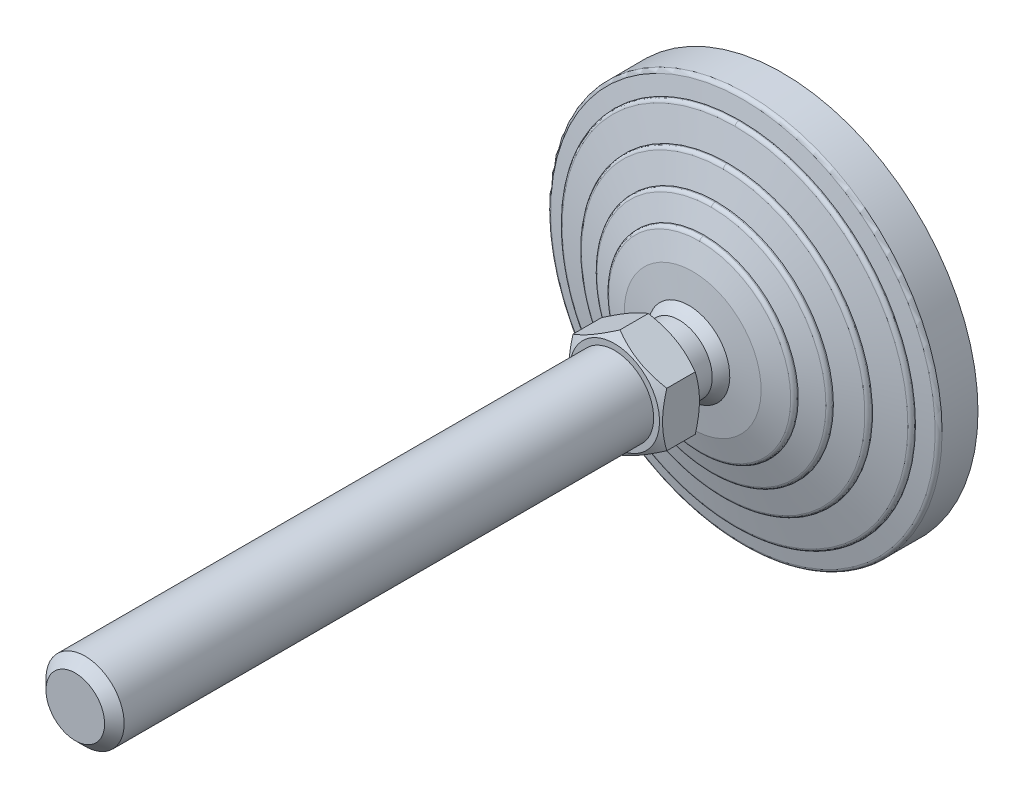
ISO-10303-21;
HEADER;
FILE_DESCRIPTION(('STEP AP214'),'2;1');
FILE_NAME('part.step','',(''),(''),'','','');
FILE_SCHEMA(('AUTOMOTIVE_DESIGN { 1 0 10303 214 1 1 1 1 }'));
ENDSEC;
DATA;
#1=APPLICATION_CONTEXT('core data for automotive mechanical design processes');
#2=APPLICATION_PROTOCOL_DEFINITION('international standard','automotive_design',2000,#1);
#3=PRODUCT_CONTEXT('',#1,'mechanical');
#4=PRODUCT('Part','Part','',(#3));
#5=PRODUCT_RELATED_PRODUCT_CATEGORY('part','',(#4));
#6=PRODUCT_DEFINITION_FORMATION('','',#4);
#7=PRODUCT_DEFINITION_CONTEXT('part definition',#1,'design');
#8=PRODUCT_DEFINITION('design','',#6,#7);
#9=PRODUCT_DEFINITION_SHAPE('','',#8);
#10=(LENGTH_UNIT() NAMED_UNIT(*) SI_UNIT(.MILLI.,.METRE.));
#11=(NAMED_UNIT(*) PLANE_ANGLE_UNIT() SI_UNIT($,.RADIAN.));
#12=(NAMED_UNIT(*) SI_UNIT($,.STERADIAN.) SOLID_ANGLE_UNIT());
#13=UNCERTAINTY_MEASURE_WITH_UNIT(LENGTH_MEASURE(1.E-05),#10,'distance_accuracy_value','');
#14=(GEOMETRIC_REPRESENTATION_CONTEXT(3) GLOBAL_UNCERTAINTY_ASSIGNED_CONTEXT((#13)) GLOBAL_UNIT_ASSIGNED_CONTEXT((#10,
#11,#12)) REPRESENTATION_CONTEXT('',''));
#15=CARTESIAN_POINT('',(0.,0.,0.));
#16=DIRECTION('',(0.,0.,1.));
#17=DIRECTION('',(1.,0.,0.));
#18=AXIS2_PLACEMENT_3D('',#15,#16,#17);
#19=CARTESIAN_POINT('',(-50.774113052,50.6,0.));
#20=DIRECTION('',(0.,0.,1.));
#21=DIRECTION('',(0.,-1.,0.));
#22=AXIS2_PLACEMENT_3D('',#19,#20,#21);
#23=PLANE('',#22);
#24=CARTESIAN_POINT('',(0.,0.,0.));
#25=DIRECTION('',(0.,0.,-1.));
#26=DIRECTION('',(1.,0.,0.));
#27=AXIS2_PLACEMENT_3D('',#24,#25,#26);
#28=CIRCLE('',#27,50.);
#29=CARTESIAN_POINT('',(50.,0.,0.));
#30=VERTEX_POINT('',#29);
#31=EDGE_CURVE('E161',#30,#30,#28,.F.);
#32=ORIENTED_EDGE('',*,*,#31,.F.);
#33=EDGE_LOOP('',(#32));
#34=FACE_BOUND('',#33,.T.);
#35=ADVANCED_FACE('F14',(#34),#23,.F.);
#36=CARTESIAN_POINT('',(0.,0.,9.180196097));
#37=DIRECTION('',(0.,0.,-1.));
#38=DIRECTION('',(1.,0.,0.));
#39=AXIS2_PLACEMENT_3D('',#36,#37,#38);
#40=CYLINDRICAL_SURFACE('',#39,50.);
#41=CARTESIAN_POINT('',(0.,0.,9.180196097));
#42=DIRECTION('',(0.,0.,1.));
#43=DIRECTION('',(0.,-1.,0.));
#44=AXIS2_PLACEMENT_3D('',#41,#42,#43);
#45=CIRCLE('',#44,50.);
#46=CARTESIAN_POINT('',(0.,-50.,9.180196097));
#47=VERTEX_POINT('',#46);
#48=EDGE_CURVE('E163',#47,#47,#45,.T.);
#49=ORIENTED_EDGE('',*,*,#48,.F.);
#50=EDGE_LOOP('',(#49));
#51=FACE_BOUND('',#50,.T.);
#52=ORIENTED_EDGE('',*,*,#31,.T.);
#53=EDGE_LOOP('',(#52));
#54=FACE_BOUND('',#53,.T.);
#55=ADVANCED_FACE('F303',(#51,#54),#40,.T.);
#56=CARTESIAN_POINT('',(0.,0.,9.18019609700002));
#57=DIRECTION('',(0.,0.,-1.));
#58=DIRECTION('',(0.,1.,0.));
#59=AXIS2_PLACEMENT_3D('',#56,#57,#58);
#60=TOROIDAL_SURFACE('',#59,48.9999999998,1.00000000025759);
#61=CARTESIAN_POINT('',(0.,0.,10.1607767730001));
#62=DIRECTION('',(0.,0.,-1.));
#63=DIRECTION('',(0.,1.,0.));
#64=AXIS2_PLACEMENT_3D('',#61,#62,#63);
#65=CIRCLE('',#64,49.196116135);
#66=CARTESIAN_POINT('',(0.,49.196116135,10.160776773));
#67=VERTEX_POINT('',#66);
#68=EDGE_CURVE('E167',#67,#67,#65,.F.);
#69=ORIENTED_EDGE('',*,*,#68,.F.);
#70=EDGE_LOOP('',(#69));
#71=FACE_BOUND('',#70,.T.);
#72=ORIENTED_EDGE('',*,*,#48,.T.);
#73=EDGE_LOOP('',(#72));
#74=FACE_BOUND('',#73,.T.);
#75=ADVANCED_FACE('F299',(#71,#74),#60,.T.);
#76=CARTESIAN_POINT('',(0.,0.,11.));
#77=DIRECTION('',(0.,0.,-1.));
#78=DIRECTION('',(0.,1.,0.));
#79=AXIS2_PLACEMENT_3D('',#76,#77,#78);
#80=CONICAL_SURFACE('',#79,45.,1.37340076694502);
#81=CARTESIAN_POINT('',(0.,0.,11.));
#82=DIRECTION('',(0.,0.,-1.));
#83=DIRECTION('',(0.,1.,0.));
#84=AXIS2_PLACEMENT_3D('',#81,#82,#83);
#85=CIRCLE('',#84,45.);
#86=CARTESIAN_POINT('',(0.,45.,11.));
#87=VERTEX_POINT('',#86);
#88=EDGE_CURVE('E854',#87,#87,#85,.F.);
#89=ORIENTED_EDGE('',*,*,#88,.F.);
#90=EDGE_LOOP('',(#89));
#91=FACE_BOUND('',#90,.T.);
#92=ORIENTED_EDGE('',*,*,#68,.T.);
#93=EDGE_LOOP('',(#92));
#94=FACE_BOUND('',#93,.T.);
#95=ADVANCED_FACE('F302',(#91,#94),#80,.T.);
#96=CARTESIAN_POINT('',(0.,0.,11.219223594));
#97=DIRECTION('',(0.,0.,-1.));
#98=DIRECTION('',(0.,1.,0.));
#99=AXIS2_PLACEMENT_3D('',#96,#97,#98);
#100=CYLINDRICAL_SURFACE('',#99,45.);
#101=CARTESIAN_POINT('',(0.,0.,11.219223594));
#102=DIRECTION('',(0.,0.,1.));
#103=DIRECTION('',(0.,-1.,0.));
#104=AXIS2_PLACEMENT_3D('',#101,#102,#103);
#105=CIRCLE('',#104,45.);
#106=CARTESIAN_POINT('',(-6.92224071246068E-09,-45.,11.219223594));
#107=VERTEX_POINT('',#106);
#108=CARTESIAN_POINT('',(-2.02035663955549E-09,45.,11.219223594));
#109=VERTEX_POINT('',#108);
#110=EDGE_CURVE('E845',#107,#109,#105,.T.);
#111=ORIENTED_EDGE('',*,*,#110,.F.);
#112=CARTESIAN_POINT('',(0.,0.,11.219223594));
#113=DIRECTION('',(0.,0.,1.));
#114=DIRECTION('',(0.,-1.,0.));
#115=AXIS2_PLACEMENT_3D('',#112,#113,#114);
#116=CIRCLE('',#115,45.);
#117=EDGE_CURVE('E825',#109,#107,#116,.T.);
#118=ORIENTED_EDGE('',*,*,#117,.F.);
#119=EDGE_LOOP('',(#111,#118));
#120=FACE_BOUND('',#119,.T.);
#121=ORIENTED_EDGE('',*,*,#88,.T.);
#122=EDGE_LOOP('',(#121));
#123=FACE_BOUND('',#122,.T.);
#124=ADVANCED_FACE('F433',(#120,#123),#100,.T.);
#125=CARTESIAN_POINT('',(0.,45.,11.219223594));
#126=CARTESIAN_POINT('',(90.0000000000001,45.,11.219223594));
#127=CARTESIAN_POINT('',(90.0000000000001,-45.,11.219223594));
#128=CARTESIAN_POINT('',(0.,-45.,11.219223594));
#129=CARTESIAN_POINT('',(0.,45.,11.696951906));
#130=CARTESIAN_POINT('',(90.,45.,11.696951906));
#131=CARTESIAN_POINT('',(90.,-45.,11.696951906));
#132=CARTESIAN_POINT('',(0.,-45.,11.696951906));
#133=CARTESIAN_POINT('',(0.,44.706000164,12.073499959));
#134=CARTESIAN_POINT('',(89.4120003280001,44.706000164,12.073499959));
#135=CARTESIAN_POINT('',(89.4120003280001,-44.706000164,12.073499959));
#136=CARTESIAN_POINT('',(0.,-44.706000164,12.073499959));
#137=CARTESIAN_POINT('',(0.,44.242535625,12.189366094));
#138=CARTESIAN_POINT('',(88.4850712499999,44.2425356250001,12.189366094));
#139=CARTESIAN_POINT('',(88.4850712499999,-44.2425356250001,12.189366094));
#140=CARTESIAN_POINT('',(0.,-44.242535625,12.189366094));
#141=(BOUNDED_SURFACE() B_SPLINE_SURFACE(3,3,((#125,#126,#127,#128),(#129,#130,#131,#132),(#133,
#134,#135,#136),(#137,#138,#139,#140)),.UNSPECIFIED.,.F.,.F.,
.F.) B_SPLINE_SURFACE_WITH_KNOTS((4,4),(4,4),(0.,1.),(0.,1.),
.UNSPECIFIED.) GEOMETRIC_REPRESENTATION_ITEM() RATIONAL_B_SPLINE_SURFACE(((1.,0.333333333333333,
0.333333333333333,1.),(0.858803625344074,0.286267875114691,0.286267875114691,0.858803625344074),
(0.858803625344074,0.286267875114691,0.286267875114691,0.858803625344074),(1.,0.333333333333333,
0.333333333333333,1.))) REPRESENTATION_ITEM('') SURFACE());
#142=CARTESIAN_POINT('',(0.,45.,11.219223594));
#143=CARTESIAN_POINT('',(0.,45.,11.696951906));
#144=CARTESIAN_POINT('',(0.,44.706000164,12.073499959));
#145=CARTESIAN_POINT('',(0.,44.242535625,12.189366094));
#146=(BOUNDED_CURVE() B_SPLINE_CURVE(3,(#142,#143,#144,#145),.UNSPECIFIED.,.F.,
.F.) B_SPLINE_CURVE_WITH_KNOTS((4,4),(0.,1.),
.UNSPECIFIED.) CURVE() GEOMETRIC_REPRESENTATION_ITEM() RATIONAL_B_SPLINE_CURVE((1.,
0.858803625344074,0.858803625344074,1.)) REPRESENTATION_ITEM(''));
#147=CARTESIAN_POINT('',(-5.95904670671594E-09,44.242535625,12.189366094));
#148=VERTEX_POINT('',#147);
#149=EDGE_CURVE('E832',#148,#109,#146,.F.);
#150=CARTESIAN_POINT('',(0.,0.,12.189366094));
#151=DIRECTION('',(0.,0.,-1.));
#152=DIRECTION('',(0.,1.,0.));
#153=AXIS2_PLACEMENT_3D('',#150,#151,#152);
#154=CIRCLE('',#153,44.242535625);
#155=CARTESIAN_POINT('',(-1.13428696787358E-08,-44.242535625,12.189366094));
#156=VERTEX_POINT('',#155);
#157=EDGE_CURVE('E822',#156,#148,#154,.F.);
#158=CARTESIAN_POINT('',(0.,-45.,11.219223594));
#159=CARTESIAN_POINT('',(0.,-45.,11.696951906));
#160=CARTESIAN_POINT('',(0.,-44.706000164,12.073499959));
#161=CARTESIAN_POINT('',(0.,-44.242535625,12.189366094));
#162=(BOUNDED_CURVE() B_SPLINE_CURVE(3,(#158,#159,#160,#161),.UNSPECIFIED.,.F.,
.F.) B_SPLINE_CURVE_WITH_KNOTS((4,4),(0.,1.),
.UNSPECIFIED.) CURVE() GEOMETRIC_REPRESENTATION_ITEM() RATIONAL_B_SPLINE_CURVE((1.,
0.858803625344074,0.858803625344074,1.)) REPRESENTATION_ITEM(''));
#163=EDGE_CURVE('E835',#107,#156,#162,.T.);
#164=ORIENTED_EDGE('',*,*,#110,.T.);
#165=ORIENTED_EDGE('',*,*,#149,.F.);
#166=ORIENTED_EDGE('',*,*,#157,.F.);
#167=ORIENTED_EDGE('',*,*,#163,.F.);
#168=EDGE_LOOP('',(#164,#165,#166,#167));
#169=FACE_BOUND('',#168,.T.);
#170=ADVANCED_FACE('F422',(#169),#141,.T.);
#171=CARTESIAN_POINT('',(0.,-45.,11.219223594));
#172=CARTESIAN_POINT('',(-90.0000000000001,-45.,11.219223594));
#173=CARTESIAN_POINT('',(-90.0000000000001,45.,11.219223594));
#174=CARTESIAN_POINT('',(0.,45.,11.219223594));
#175=CARTESIAN_POINT('',(0.,-45.,11.696951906));
#176=CARTESIAN_POINT('',(-90.,-45.,11.696951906));
#177=CARTESIAN_POINT('',(-90.,45.,11.696951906));
#178=CARTESIAN_POINT('',(0.,45.,11.696951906));
#179=CARTESIAN_POINT('',(0.,-44.706000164,12.073499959));
#180=CARTESIAN_POINT('',(-89.4120003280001,-44.706000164,12.073499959));
#181=CARTESIAN_POINT('',(-89.4120003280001,44.706000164,12.073499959));
#182=CARTESIAN_POINT('',(0.,44.706000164,12.073499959));
#183=CARTESIAN_POINT('',(0.,-44.242535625,12.189366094));
#184=CARTESIAN_POINT('',(-88.4850712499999,-44.2425356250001,12.189366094));
#185=CARTESIAN_POINT('',(-88.4850712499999,44.2425356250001,12.189366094));
#186=CARTESIAN_POINT('',(0.,44.242535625,12.189366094));
#187=(BOUNDED_SURFACE() B_SPLINE_SURFACE(3,3,((#171,#172,#173,#174),(#175,#176,#177,#178),(#179,
#180,#181,#182),(#183,#184,#185,#186)),.UNSPECIFIED.,.F.,.F.,
.F.) B_SPLINE_SURFACE_WITH_KNOTS((4,4),(4,4),(0.,1.),(0.,1.),
.UNSPECIFIED.) GEOMETRIC_REPRESENTATION_ITEM() RATIONAL_B_SPLINE_SURFACE(((1.,0.333333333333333,
0.333333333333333,1.),(0.858803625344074,0.286267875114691,0.286267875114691,0.858803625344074),
(0.858803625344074,0.286267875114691,0.286267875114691,0.858803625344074),(1.,0.333333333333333,
0.333333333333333,1.))) REPRESENTATION_ITEM('') SURFACE());
#188=CARTESIAN_POINT('',(0.,0.,12.189366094));
#189=DIRECTION('',(0.,0.,-1.));
#190=DIRECTION('',(0.,1.,0.));
#191=AXIS2_PLACEMENT_3D('',#188,#189,#190);
#192=CIRCLE('',#191,44.242535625);
#193=EDGE_CURVE('E821',#148,#156,#192,.F.);
#194=ORIENTED_EDGE('',*,*,#149,.T.);
#195=ORIENTED_EDGE('',*,*,#117,.T.);
#196=ORIENTED_EDGE('',*,*,#163,.T.);
#197=ORIENTED_EDGE('',*,*,#193,.F.);
#198=EDGE_LOOP('',(#194,#195,#196,#197));
#199=FACE_BOUND('',#198,.T.);
#200=ADVANCED_FACE('F416',(#199),#187,.T.);
#201=CARTESIAN_POINT('',(0.,0.,14.));
#202=DIRECTION('',(0.,0.,-1.));
#203=DIRECTION('',(1.,0.,0.));
#204=AXIS2_PLACEMENT_3D('',#201,#202,#203);
#205=CONICAL_SURFACE('',#204,37.,1.32581766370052);
#206=CARTESIAN_POINT('',(0.,0.,14.));
#207=DIRECTION('',(0.,0.,-1.));
#208=DIRECTION('',(0.,1.,0.));
#209=AXIS2_PLACEMENT_3D('',#206,#207,#208);
#210=CIRCLE('',#209,37.);
#211=CARTESIAN_POINT('',(0.,37.,14.));
#212=VERTEX_POINT('',#211);
#213=EDGE_CURVE('E812',#212,#212,#210,.F.);
#214=ORIENTED_EDGE('',*,*,#213,.F.);
#215=EDGE_LOOP('',(#214));
#216=FACE_BOUND('',#215,.T.);
#217=ORIENTED_EDGE('',*,*,#193,.T.);
#218=ORIENTED_EDGE('',*,*,#157,.T.);
#219=EDGE_LOOP('',(#217,#218));
#220=FACE_BOUND('',#219,.T.);
#221=ADVANCED_FACE('F412',(#216,#220),#205,.T.);
#222=CARTESIAN_POINT('',(0.,0.,14.245698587));
#223=DIRECTION('',(0.,0.,-1.));
#224=DIRECTION('',(1.,0.,0.));
#225=AXIS2_PLACEMENT_3D('',#222,#223,#224);
#226=CYLINDRICAL_SURFACE('',#225,37.);
#227=CARTESIAN_POINT('',(0.,0.,14.245698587));
#228=DIRECTION('',(0.,0.,1.));
#229=DIRECTION('',(0.,-1.,0.));
#230=AXIS2_PLACEMENT_3D('',#227,#228,#229);
#231=CIRCLE('',#230,37.);
#232=CARTESIAN_POINT('',(-5.69162014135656E-09,-37.,14.245698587));
#233=VERTEX_POINT('',#232);
#234=CARTESIAN_POINT('',(-1.66118212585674E-09,37.,14.245698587));
#235=VERTEX_POINT('',#234);
#236=EDGE_CURVE('E803',#233,#235,#231,.T.);
#237=ORIENTED_EDGE('',*,*,#236,.F.);
#238=CARTESIAN_POINT('',(0.,0.,14.245698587));
#239=DIRECTION('',(0.,0.,1.));
#240=DIRECTION('',(0.,-1.,0.));
#241=AXIS2_PLACEMENT_3D('',#238,#239,#240);
#242=CIRCLE('',#241,37.);
#243=EDGE_CURVE('E783',#235,#233,#242,.T.);
#244=ORIENTED_EDGE('',*,*,#243,.F.);
#245=EDGE_LOOP('',(#237,#244));
#246=FACE_BOUND('',#245,.T.);
#247=ORIENTED_EDGE('',*,*,#213,.T.);
#248=EDGE_LOOP('',(#247));
#249=FACE_BOUND('',#248,.T.);
#250=ADVANCED_FACE('F403',(#246,#249),#226,.T.);
#251=CARTESIAN_POINT('',(0.,37.,14.245698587));
#252=CARTESIAN_POINT('',(74.,37.,14.245698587));
#253=CARTESIAN_POINT('',(74.,-37.,14.245698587));
#254=CARTESIAN_POINT('',(0.,-37.,14.245698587));
#255=CARTESIAN_POINT('',(0.,37.,14.709515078));
#256=CARTESIAN_POINT('',(74.,37.,14.709515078));
#257=CARTESIAN_POINT('',(74.,-37.,14.709515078));
#258=CARTESIAN_POINT('',(0.,-37.,14.709515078));
#259=CARTESIAN_POINT('',(0.,36.720691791,15.079802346));
#260=CARTESIAN_POINT('',(73.441383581,36.720691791,15.079802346));
#261=CARTESIAN_POINT('',(73.441383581,-36.720691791,15.079802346));
#262=CARTESIAN_POINT('',(0.,-36.720691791,15.079802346));
#263=CARTESIAN_POINT('',(0.,36.274721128,15.207222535));
#264=CARTESIAN_POINT('',(72.549442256,36.274721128,15.207222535));
#265=CARTESIAN_POINT('',(72.549442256,-36.274721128,15.207222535));
#266=CARTESIAN_POINT('',(0.,-36.274721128,15.207222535));
#267=(BOUNDED_SURFACE() B_SPLINE_SURFACE(3,3,((#251,#252,#253,#254),(#255,#256,#257,#258),(#259,
#260,#261,#262),(#263,#264,#265,#266)),.UNSPECIFIED.,.F.,.F.,
.F.) B_SPLINE_SURFACE_WITH_KNOTS((4,4),(4,4),(0.,1.),(0.,1.),
.UNSPECIFIED.) GEOMETRIC_REPRESENTATION_ITEM() RATIONAL_B_SPLINE_SURFACE(((1.,0.333333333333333,
0.333333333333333,1.),(0.865565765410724,0.288521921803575,0.288521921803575,0.865565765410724),
(0.865565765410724,0.288521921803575,0.288521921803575,0.865565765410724),(1.,0.333333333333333,
0.333333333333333,1.))) REPRESENTATION_ITEM('') SURFACE());
#268=CARTESIAN_POINT('',(0.,37.,14.245698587));
#269=CARTESIAN_POINT('',(0.,37.,14.709515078));
#270=CARTESIAN_POINT('',(0.,36.720691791,15.079802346));
#271=CARTESIAN_POINT('',(0.,36.274721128,15.207222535));
#272=(BOUNDED_CURVE() B_SPLINE_CURVE(3,(#268,#269,#270,#271),.UNSPECIFIED.,.F.,
.F.) B_SPLINE_CURVE_WITH_KNOTS((4,4),(0.,1.),
.UNSPECIFIED.) CURVE() GEOMETRIC_REPRESENTATION_ITEM() RATIONAL_B_SPLINE_CURVE((1.,
0.865565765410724,0.865565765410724,1.)) REPRESENTATION_ITEM(''));
#273=CARTESIAN_POINT('',(-4.88585824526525E-09,36.274721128,15.2072225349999));
#274=VERTEX_POINT('',#273);
#275=EDGE_CURVE('E790',#274,#235,#272,.F.);
#276=CARTESIAN_POINT('',(0.,0.,15.2072225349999));
#277=DIRECTION('',(0.,0.,-1.));
#278=DIRECTION('',(0.,1.,0.));
#279=AXIS2_PLACEMENT_3D('',#276,#277,#278);
#280=CIRCLE('',#279,36.274721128);
#281=CARTESIAN_POINT('',(-9.30008708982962E-09,-36.274721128,15.2072225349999));
#282=VERTEX_POINT('',#281);
#283=EDGE_CURVE('E780',#282,#274,#280,.F.);
#284=CARTESIAN_POINT('',(0.,-37.,14.245698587));
#285=CARTESIAN_POINT('',(0.,-37.,14.709515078));
#286=CARTESIAN_POINT('',(0.,-36.720691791,15.079802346));
#287=CARTESIAN_POINT('',(0.,-36.274721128,15.207222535));
#288=(BOUNDED_CURVE() B_SPLINE_CURVE(3,(#284,#285,#286,#287),.UNSPECIFIED.,.F.,
.F.) B_SPLINE_CURVE_WITH_KNOTS((4,4),(0.,1.),
.UNSPECIFIED.) CURVE() GEOMETRIC_REPRESENTATION_ITEM() RATIONAL_B_SPLINE_CURVE((1.,
0.865565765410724,0.865565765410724,1.)) REPRESENTATION_ITEM(''));
#289=EDGE_CURVE('E793',#233,#282,#288,.T.);
#290=ORIENTED_EDGE('',*,*,#236,.T.);
#291=ORIENTED_EDGE('',*,*,#275,.F.);
#292=ORIENTED_EDGE('',*,*,#283,.F.);
#293=ORIENTED_EDGE('',*,*,#289,.F.);
#294=EDGE_LOOP('',(#290,#291,#292,#293));
#295=FACE_BOUND('',#294,.T.);
#296=ADVANCED_FACE('F392',(#295),#267,.T.);
#297=CARTESIAN_POINT('',(0.,-37.,14.245698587));
#298=CARTESIAN_POINT('',(-74.,-37.,14.245698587));
#299=CARTESIAN_POINT('',(-74.,37.,14.245698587));
#300=CARTESIAN_POINT('',(0.,37.,14.245698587));
#301=CARTESIAN_POINT('',(0.,-37.,14.709515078));
#302=CARTESIAN_POINT('',(-74.,-37.,14.709515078));
#303=CARTESIAN_POINT('',(-74.,37.,14.709515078));
#304=CARTESIAN_POINT('',(0.,37.,14.709515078));
#305=CARTESIAN_POINT('',(0.,-36.720691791,15.079802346));
#306=CARTESIAN_POINT('',(-73.441383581,-36.720691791,15.079802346));
#307=CARTESIAN_POINT('',(-73.441383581,36.720691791,15.079802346));
#308=CARTESIAN_POINT('',(0.,36.720691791,15.079802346));
#309=CARTESIAN_POINT('',(0.,-36.274721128,15.207222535));
#310=CARTESIAN_POINT('',(-72.549442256,-36.274721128,15.207222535));
#311=CARTESIAN_POINT('',(-72.549442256,36.274721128,15.207222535));
#312=CARTESIAN_POINT('',(0.,36.274721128,15.207222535));
#313=(BOUNDED_SURFACE() B_SPLINE_SURFACE(3,3,((#297,#298,#299,#300),(#301,#302,#303,#304),(#305,
#306,#307,#308),(#309,#310,#311,#312)),.UNSPECIFIED.,.F.,.F.,
.F.) B_SPLINE_SURFACE_WITH_KNOTS((4,4),(4,4),(0.,1.),(0.,1.),
.UNSPECIFIED.) GEOMETRIC_REPRESENTATION_ITEM() RATIONAL_B_SPLINE_SURFACE(((1.,0.333333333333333,
0.333333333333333,1.),(0.865565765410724,0.288521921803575,0.288521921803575,0.865565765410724),
(0.865565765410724,0.288521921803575,0.288521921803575,0.865565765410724),(1.,0.333333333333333,
0.333333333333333,1.))) REPRESENTATION_ITEM('') SURFACE());
#314=CARTESIAN_POINT('',(0.,0.,15.2072225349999));
#315=DIRECTION('',(0.,0.,-1.));
#316=DIRECTION('',(0.,1.,0.));
#317=AXIS2_PLACEMENT_3D('',#314,#315,#316);
#318=CIRCLE('',#317,36.274721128);
#319=EDGE_CURVE('E779',#274,#282,#318,.F.);
#320=ORIENTED_EDGE('',*,*,#275,.T.);
#321=ORIENTED_EDGE('',*,*,#243,.T.);
#322=ORIENTED_EDGE('',*,*,#289,.T.);
#323=ORIENTED_EDGE('',*,*,#319,.F.);
#324=EDGE_LOOP('',(#320,#321,#322,#323));
#325=FACE_BOUND('',#324,.T.);
#326=ADVANCED_FACE('F386',(#325),#313,.T.);
#327=CARTESIAN_POINT('',(0.,0.,17.));
#328=DIRECTION('',(0.,0.,-1.));
#329=DIRECTION('',(0.,1.,0.));
#330=AXIS2_PLACEMENT_3D('',#327,#328,#329);
#331=CONICAL_SURFACE('',#330,30.,1.29249666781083);
#332=CARTESIAN_POINT('',(0.,0.,17.));
#333=DIRECTION('',(0.,0.,-1.));
#334=DIRECTION('',(0.,1.,0.));
#335=AXIS2_PLACEMENT_3D('',#332,#333,#334);
#336=CIRCLE('',#335,30.);
#337=CARTESIAN_POINT('',(0.,30.,17.));
#338=VERTEX_POINT('',#337);
#339=EDGE_CURVE('E770',#338,#338,#336,.F.);
#340=ORIENTED_EDGE('',*,*,#339,.F.);
#341=EDGE_LOOP('',(#340));
#342=FACE_BOUND('',#341,.T.);
#343=ORIENTED_EDGE('',*,*,#319,.T.);
#344=ORIENTED_EDGE('',*,*,#283,.T.);
#345=EDGE_LOOP('',(#343,#344));
#346=FACE_BOUND('',#345,.T.);
#347=ADVANCED_FACE('F382',(#342,#346),#331,.T.);
#348=CARTESIAN_POINT('',(0.,0.,17.27924078));
#349=DIRECTION('',(0.,0.,-1.));
#350=DIRECTION('',(0.,1.,0.));
#351=AXIS2_PLACEMENT_3D('',#348,#349,#350);
#352=CYLINDRICAL_SURFACE('',#351,30.);
#353=CARTESIAN_POINT('',(0.,0.,17.27924078));
#354=DIRECTION('',(0.,0.,1.));
#355=DIRECTION('',(0.,-1.,0.));
#356=AXIS2_PLACEMENT_3D('',#353,#354,#355);
#357=CIRCLE('',#356,30.);
#358=CARTESIAN_POINT('',(-4.61482714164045E-09,-30.,17.27924078));
#359=VERTEX_POINT('',#358);
#360=CARTESIAN_POINT('',(-1.34690442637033E-09,30.,17.27924078));
#361=VERTEX_POINT('',#360);
#362=EDGE_CURVE('E761',#359,#361,#357,.T.);
#363=ORIENTED_EDGE('',*,*,#362,.F.);
#364=CARTESIAN_POINT('',(0.,0.,17.27924078));
#365=DIRECTION('',(0.,0.,1.));
#366=DIRECTION('',(0.,-1.,0.));
#367=AXIS2_PLACEMENT_3D('',#364,#365,#366);
#368=CIRCLE('',#367,30.);
#369=EDGE_CURVE('E741',#361,#359,#368,.T.);
#370=ORIENTED_EDGE('',*,*,#369,.F.);
#371=EDGE_LOOP('',(#363,#370));
#372=FACE_BOUND('',#371,.T.);
#373=ORIENTED_EDGE('',*,*,#339,.T.);
#374=EDGE_LOOP('',(#373));
#375=FACE_BOUND('',#374,.T.);
#376=ADVANCED_FACE('F373',(#372,#375),#352,.T.);
#377=CARTESIAN_POINT('',(0.,30.,17.27924078));
#378=CARTESIAN_POINT('',(60.0000000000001,30.,17.27924078));
#379=CARTESIAN_POINT('',(60.0000000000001,-30.,17.27924078));
#380=CARTESIAN_POINT('',(0.,-30.,17.27924078));
#381=CARTESIAN_POINT('',(0.,30.,17.725161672));
#382=CARTESIAN_POINT('',(60.,30.,17.725161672));
#383=CARTESIAN_POINT('',(60.,-30.,17.725161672));
#384=CARTESIAN_POINT('',(0.,-30.,17.725161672));
#385=CARTESIAN_POINT('',(0.,29.739265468,18.086911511));
#386=CARTESIAN_POINT('',(59.4785309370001,29.739265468,18.086911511));
#387=CARTESIAN_POINT('',(59.4785309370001,-29.739265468,18.086911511));
#388=CARTESIAN_POINT('',(0.,-29.739265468,18.086911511));
#389=CARTESIAN_POINT('',(0.,29.316227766,18.227924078));
#390=CARTESIAN_POINT('',(58.6324555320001,29.316227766,18.227924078));
#391=CARTESIAN_POINT('',(58.6324555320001,-29.316227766,18.227924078));
#392=CARTESIAN_POINT('',(0.,-29.316227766,18.227924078));
#393=(BOUNDED_SURFACE() B_SPLINE_SURFACE(3,3,((#377,#378,#379,#380),(#381,#382,#383,#384),(#385,
#386,#387,#388),(#389,#390,#391,#392)),.UNSPECIFIED.,.F.,.F.,
.F.) B_SPLINE_SURFACE_WITH_KNOTS((4,4),(4,4),(0.,1.),(0.,1.),
.UNSPECIFIED.) GEOMETRIC_REPRESENTATION_ITEM() RATIONAL_B_SPLINE_SURFACE(((1.,0.333333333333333,
0.333333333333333,1.),(0.874161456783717,0.291387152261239,0.291387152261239,0.874161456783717),
(0.874161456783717,0.291387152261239,0.291387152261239,0.874161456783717),(1.,0.333333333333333,
0.333333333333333,1.))) REPRESENTATION_ITEM('') SURFACE());
#394=CARTESIAN_POINT('',(0.,30.,17.27924078));
#395=CARTESIAN_POINT('',(0.,30.,17.725161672));
#396=CARTESIAN_POINT('',(0.,29.739265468,18.086911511));
#397=CARTESIAN_POINT('',(0.,29.316227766,18.227924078));
#398=(BOUNDED_CURVE() B_SPLINE_CURVE(3,(#394,#395,#396,#397),.UNSPECIFIED.,.F.,
.F.) B_SPLINE_CURVE_WITH_KNOTS((4,4),(0.,1.),
.UNSPECIFIED.) CURVE() GEOMETRIC_REPRESENTATION_ITEM() RATIONAL_B_SPLINE_CURVE((1.,
0.874161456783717,0.874161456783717,1.)) REPRESENTATION_ITEM(''));
#399=CARTESIAN_POINT('',(-3.94861569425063E-09,29.3162277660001,18.2279240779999));
#400=VERTEX_POINT('',#399);
#401=EDGE_CURVE('E748',#400,#361,#398,.F.);
#402=CARTESIAN_POINT('',(0.,0.,18.2279240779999));
#403=DIRECTION('',(0.,0.,-1.));
#404=DIRECTION('',(0.,1.,0.));
#405=AXIS2_PLACEMENT_3D('',#402,#403,#404);
#406=CIRCLE('',#405,29.316227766);
#407=CARTESIAN_POINT('',(-7.51607353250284E-09,-29.3162277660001,18.2279240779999));
#408=VERTEX_POINT('',#407);
#409=EDGE_CURVE('E738',#408,#400,#406,.F.);
#410=CARTESIAN_POINT('',(0.,-30.,17.27924078));
#411=CARTESIAN_POINT('',(0.,-30.,17.725161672));
#412=CARTESIAN_POINT('',(0.,-29.739265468,18.086911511));
#413=CARTESIAN_POINT('',(0.,-29.316227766,18.227924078));
#414=(BOUNDED_CURVE() B_SPLINE_CURVE(3,(#410,#411,#412,#413),.UNSPECIFIED.,.F.,
.F.) B_SPLINE_CURVE_WITH_KNOTS((4,4),(0.,1.),
.UNSPECIFIED.) CURVE() GEOMETRIC_REPRESENTATION_ITEM() RATIONAL_B_SPLINE_CURVE((1.,
0.874161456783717,0.874161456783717,1.)) REPRESENTATION_ITEM(''));
#415=EDGE_CURVE('E751',#359,#408,#414,.T.);
#416=ORIENTED_EDGE('',*,*,#362,.T.);
#417=ORIENTED_EDGE('',*,*,#401,.F.);
#418=ORIENTED_EDGE('',*,*,#409,.F.);
#419=ORIENTED_EDGE('',*,*,#415,.F.);
#420=EDGE_LOOP('',(#416,#417,#418,#419));
#421=FACE_BOUND('',#420,.T.);
#422=ADVANCED_FACE('F362',(#421),#393,.T.);
#423=CARTESIAN_POINT('',(0.,-30.,17.27924078));
#424=CARTESIAN_POINT('',(-60.0000000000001,-30.,17.27924078));
#425=CARTESIAN_POINT('',(-60.0000000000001,30.,17.27924078));
#426=CARTESIAN_POINT('',(0.,30.,17.27924078));
#427=CARTESIAN_POINT('',(0.,-30.,17.725161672));
#428=CARTESIAN_POINT('',(-60.,-30.,17.725161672));
#429=CARTESIAN_POINT('',(-60.,30.,17.725161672));
#430=CARTESIAN_POINT('',(0.,30.,17.725161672));
#431=CARTESIAN_POINT('',(0.,-29.739265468,18.086911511));
#432=CARTESIAN_POINT('',(-59.4785309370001,-29.739265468,18.086911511));
#433=CARTESIAN_POINT('',(-59.4785309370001,29.739265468,18.086911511));
#434=CARTESIAN_POINT('',(0.,29.739265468,18.086911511));
#435=CARTESIAN_POINT('',(0.,-29.316227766,18.227924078));
#436=CARTESIAN_POINT('',(-58.6324555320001,-29.316227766,18.227924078));
#437=CARTESIAN_POINT('',(-58.6324555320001,29.316227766,18.227924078));
#438=CARTESIAN_POINT('',(0.,29.316227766,18.227924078));
#439=(BOUNDED_SURFACE() B_SPLINE_SURFACE(3,3,((#423,#424,#425,#426),(#427,#428,#429,#430),(#431,
#432,#433,#434),(#435,#436,#437,#438)),.UNSPECIFIED.,.F.,.F.,
.F.) B_SPLINE_SURFACE_WITH_KNOTS((4,4),(4,4),(0.,1.),(0.,1.),
.UNSPECIFIED.) GEOMETRIC_REPRESENTATION_ITEM() RATIONAL_B_SPLINE_SURFACE(((1.,0.333333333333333,
0.333333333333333,1.),(0.874161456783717,0.291387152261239,0.291387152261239,0.874161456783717),
(0.874161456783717,0.291387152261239,0.291387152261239,0.874161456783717),(1.,0.333333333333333,
0.333333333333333,1.))) REPRESENTATION_ITEM('') SURFACE());
#440=CARTESIAN_POINT('',(0.,0.,18.2279240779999));
#441=DIRECTION('',(0.,0.,-1.));
#442=DIRECTION('',(0.,1.,0.));
#443=AXIS2_PLACEMENT_3D('',#440,#441,#442);
#444=CIRCLE('',#443,29.316227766);
#445=EDGE_CURVE('E737',#400,#408,#444,.F.);
#446=ORIENTED_EDGE('',*,*,#401,.T.);
#447=ORIENTED_EDGE('',*,*,#369,.T.);
#448=ORIENTED_EDGE('',*,*,#415,.T.);
#449=ORIENTED_EDGE('',*,*,#445,.F.);
#450=EDGE_LOOP('',(#446,#447,#448,#449));
#451=FACE_BOUND('',#450,.T.);
#452=ADVANCED_FACE('F356',(#451),#439,.T.);
#453=CARTESIAN_POINT('',(0.,0.,20.));
#454=DIRECTION('',(0.,0.,-1.));
#455=DIRECTION('',(1.,0.,0.));
#456=AXIS2_PLACEMENT_3D('',#453,#454,#455);
#457=CONICAL_SURFACE('',#456,24.,1.24904577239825);
#458=CARTESIAN_POINT('',(0.,0.,20.));
#459=DIRECTION('',(0.,0.,-1.));
#460=DIRECTION('',(0.,1.,0.));
#461=AXIS2_PLACEMENT_3D('',#458,#459,#460);
#462=CIRCLE('',#461,24.);
#463=CARTESIAN_POINT('',(0.,24.,20.));
#464=VERTEX_POINT('',#463);
#465=EDGE_CURVE('E728',#464,#464,#462,.F.);
#466=ORIENTED_EDGE('',*,*,#465,.F.);
#467=EDGE_LOOP('',(#466));
#468=FACE_BOUND('',#467,.T.);
#469=ORIENTED_EDGE('',*,*,#445,.T.);
#470=ORIENTED_EDGE('',*,*,#409,.T.);
#471=EDGE_LOOP('',(#469,#470));
#472=FACE_BOUND('',#471,.T.);
#473=ADVANCED_FACE('F352',(#468,#472),#457,.T.);
#474=CARTESIAN_POINT('',(0.,0.,20.261425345));
#475=DIRECTION('',(0.,0.,-1.));
#476=DIRECTION('',(0.,1.,0.));
#477=AXIS2_PLACEMENT_3D('',#474,#475,#476);
#478=CYLINDRICAL_SURFACE('',#477,24.);
#479=CARTESIAN_POINT('',(0.,0.,20.261425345));
#480=DIRECTION('',(0.,0.,1.));
#481=DIRECTION('',(0.,-1.,0.));
#482=AXIS2_PLACEMENT_3D('',#479,#480,#481);
#483=CIRCLE('',#482,24.);
#484=CARTESIAN_POINT('',(-3.69186171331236E-09,-24.,20.261425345));
#485=VERTEX_POINT('',#484);
#486=CARTESIAN_POINT('',(-1.07752354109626E-09,24.,20.261425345));
#487=VERTEX_POINT('',#486);
#488=EDGE_CURVE('E719',#485,#487,#483,.T.);
#489=ORIENTED_EDGE('',*,*,#488,.F.);
#490=CARTESIAN_POINT('',(0.,0.,20.261425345));
#491=DIRECTION('',(0.,0.,1.));
#492=DIRECTION('',(0.,-1.,0.));
#493=AXIS2_PLACEMENT_3D('',#490,#491,#492);
#494=CIRCLE('',#493,24.);
#495=EDGE_CURVE('E699',#487,#485,#494,.T.);
#496=ORIENTED_EDGE('',*,*,#495,.F.);
#497=EDGE_LOOP('',(#489,#496));
#498=FACE_BOUND('',#497,.T.);
#499=ORIENTED_EDGE('',*,*,#465,.T.);
#500=EDGE_LOOP('',(#499));
#501=FACE_BOUND('',#500,.T.);
#502=ADVANCED_FACE('F343',(#498,#501),#478,.T.);
#503=CARTESIAN_POINT('',(0.,24.,20.261425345));
#504=CARTESIAN_POINT('',(48.,24.,20.261425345));
#505=CARTESIAN_POINT('',(48.,-24.,20.261425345));
#506=CARTESIAN_POINT('',(0.,-24.,20.261425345));
#507=CARTESIAN_POINT('',(0.,24.,20.716888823));
#508=CARTESIAN_POINT('',(48.,24.,20.716888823));
#509=CARTESIAN_POINT('',(48.,-24.,20.716888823));
#510=CARTESIAN_POINT('',(0.,-24.,20.716888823));
#511=CARTESIAN_POINT('',(0.,23.72940828,21.083258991));
#512=CARTESIAN_POINT('',(47.458816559,23.72940828,21.083258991));
#513=CARTESIAN_POINT('',(47.458816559,-23.72940828,21.083258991));
#514=CARTESIAN_POINT('',(0.,-23.72940828,21.083258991));
#515=CARTESIAN_POINT('',(0.,23.294085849,21.217204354));
#516=CARTESIAN_POINT('',(46.5881716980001,23.294085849,21.217204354));
#517=CARTESIAN_POINT('',(46.5881716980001,-23.294085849,21.217204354));
#518=CARTESIAN_POINT('',(0.,-23.294085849,21.217204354));
#519=(BOUNDED_SURFACE() B_SPLINE_SURFACE(3,3,((#503,#504,#505,#506),(#507,#508,#509,#510),(#511,
#512,#513,#514),(#515,#516,#517,#518)),.UNSPECIFIED.,.F.,.F.,
.F.) B_SPLINE_SURFACE_WITH_KNOTS((4,4),(4,4),(0.,1.),(0.,1.),
.UNSPECIFIED.) GEOMETRIC_REPRESENTATION_ITEM() RATIONAL_B_SPLINE_SURFACE(((1.,0.333333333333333,
0.333333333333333,1.),(0.869593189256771,0.289864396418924,0.289864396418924,0.869593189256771),
(0.869593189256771,0.289864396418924,0.289864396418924,0.869593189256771),(1.,0.333333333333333,
0.333333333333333,1.))) REPRESENTATION_ITEM('') SURFACE());
#520=CARTESIAN_POINT('',(0.,24.,20.261425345));
#521=CARTESIAN_POINT('',(0.,24.,20.716888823));
#522=CARTESIAN_POINT('',(0.,23.72940828,21.083258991));
#523=CARTESIAN_POINT('',(0.,23.294085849,21.217204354));
#524=(BOUNDED_CURVE() B_SPLINE_CURVE(3,(#520,#521,#522,#523),.UNSPECIFIED.,.F.,
.F.) B_SPLINE_CURVE_WITH_KNOTS((4,4),(0.,1.),
.UNSPECIFIED.) CURVE() GEOMETRIC_REPRESENTATION_ITEM() RATIONAL_B_SPLINE_CURVE((1.,
0.869593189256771,0.869593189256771,1.)) REPRESENTATION_ITEM(''));
#525=CARTESIAN_POINT('',(-3.13749073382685E-09,23.294085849,21.217204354));
#526=VERTEX_POINT('',#525);
#527=EDGE_CURVE('E706',#526,#487,#524,.F.);
#528=CARTESIAN_POINT('',(0.,0.,21.217204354));
#529=DIRECTION('',(0.,0.,-1.));
#530=DIRECTION('',(0.,1.,0.));
#531=AXIS2_PLACEMENT_3D('',#528,#529,#530);
#532=CIRCLE('',#531,23.294085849);
#533=CARTESIAN_POINT('',(-5.97212108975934E-09,-23.294085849,21.217204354));
#534=VERTEX_POINT('',#533);
#535=EDGE_CURVE('E696',#534,#526,#532,.F.);
#536=CARTESIAN_POINT('',(0.,-24.,20.261425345));
#537=CARTESIAN_POINT('',(0.,-24.,20.716888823));
#538=CARTESIAN_POINT('',(0.,-23.72940828,21.083258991));
#539=CARTESIAN_POINT('',(0.,-23.294085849,21.217204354));
#540=(BOUNDED_CURVE() B_SPLINE_CURVE(3,(#536,#537,#538,#539),.UNSPECIFIED.,.F.,
.F.) B_SPLINE_CURVE_WITH_KNOTS((4,4),(0.,1.),
.UNSPECIFIED.) CURVE() GEOMETRIC_REPRESENTATION_ITEM() RATIONAL_B_SPLINE_CURVE((1.,
0.869593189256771,0.869593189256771,1.)) REPRESENTATION_ITEM(''));
#541=EDGE_CURVE('E709',#485,#534,#540,.T.);
#542=ORIENTED_EDGE('',*,*,#488,.T.);
#543=ORIENTED_EDGE('',*,*,#527,.F.);
#544=ORIENTED_EDGE('',*,*,#535,.F.);
#545=ORIENTED_EDGE('',*,*,#541,.F.);
#546=EDGE_LOOP('',(#542,#543,#544,#545));
#547=FACE_BOUND('',#546,.T.);
#548=ADVANCED_FACE('F332',(#547),#519,.T.);
#549=CARTESIAN_POINT('',(0.,-24.,20.261425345));
#550=CARTESIAN_POINT('',(-48.,-24.,20.261425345));
#551=CARTESIAN_POINT('',(-48.,24.,20.261425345));
#552=CARTESIAN_POINT('',(0.,24.,20.261425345));
#553=CARTESIAN_POINT('',(0.,-24.,20.716888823));
#554=CARTESIAN_POINT('',(-48.,-24.,20.716888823));
#555=CARTESIAN_POINT('',(-48.,24.,20.716888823));
#556=CARTESIAN_POINT('',(0.,24.,20.716888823));
#557=CARTESIAN_POINT('',(0.,-23.72940828,21.083258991));
#558=CARTESIAN_POINT('',(-47.458816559,-23.72940828,21.083258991));
#559=CARTESIAN_POINT('',(-47.458816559,23.72940828,21.083258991));
#560=CARTESIAN_POINT('',(0.,23.72940828,21.083258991));
#561=CARTESIAN_POINT('',(0.,-23.294085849,21.217204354));
#562=CARTESIAN_POINT('',(-46.5881716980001,-23.294085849,21.217204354));
#563=CARTESIAN_POINT('',(-46.5881716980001,23.294085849,21.217204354));
#564=CARTESIAN_POINT('',(0.,23.294085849,21.217204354));
#565=(BOUNDED_SURFACE() B_SPLINE_SURFACE(3,3,((#549,#550,#551,#552),(#553,#554,#555,#556),(#557,
#558,#559,#560),(#561,#562,#563,#564)),.UNSPECIFIED.,.F.,.F.,
.F.) B_SPLINE_SURFACE_WITH_KNOTS((4,4),(4,4),(0.,1.),(0.,1.),
.UNSPECIFIED.) GEOMETRIC_REPRESENTATION_ITEM() RATIONAL_B_SPLINE_SURFACE(((1.,0.333333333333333,
0.333333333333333,1.),(0.869593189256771,0.289864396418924,0.289864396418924,0.869593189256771),
(0.869593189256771,0.289864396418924,0.289864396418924,0.869593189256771),(1.,0.333333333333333,
0.333333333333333,1.))) REPRESENTATION_ITEM('') SURFACE());
#566=CARTESIAN_POINT('',(0.,0.,21.217204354));
#567=DIRECTION('',(0.,0.,-1.));
#568=DIRECTION('',(0.,1.,0.));
#569=AXIS2_PLACEMENT_3D('',#566,#567,#568);
#570=CIRCLE('',#569,23.294085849);
#571=EDGE_CURVE('E695',#526,#534,#570,.F.);
#572=ORIENTED_EDGE('',*,*,#527,.T.);
#573=ORIENTED_EDGE('',*,*,#495,.T.);
#574=ORIENTED_EDGE('',*,*,#541,.T.);
#575=ORIENTED_EDGE('',*,*,#571,.F.);
#576=EDGE_LOOP('',(#572,#573,#574,#575));
#577=FACE_BOUND('',#576,.T.);
#578=ADVANCED_FACE('F326',(#577),#565,.T.);
#579=CARTESIAN_POINT('',(0.,0.,23.));
#580=DIRECTION('',(0.,0.,-1.));
#581=DIRECTION('',(0.,1.,0.));
#582=AXIS2_PLACEMENT_3D('',#579,#580,#581);
#583=CONICAL_SURFACE('',#582,17.5,1.27229739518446);
#584=CARTESIAN_POINT('',(0.,0.,23.));
#585=DIRECTION('',(0.,0.,-1.));
#586=DIRECTION('',(0.,1.,0.));
#587=AXIS2_PLACEMENT_3D('',#584,#585,#586);
#588=CIRCLE('',#587,17.5);
#589=CARTESIAN_POINT('',(0.,17.5,23.0000000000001));
#590=VERTEX_POINT('',#589);
#591=EDGE_CURVE('E692',#590,#590,#588,.F.);
#592=ORIENTED_EDGE('',*,*,#591,.F.);
#593=EDGE_LOOP('',(#592));
#594=FACE_BOUND('',#593,.T.);
#595=ORIENTED_EDGE('',*,*,#571,.T.);
#596=ORIENTED_EDGE('',*,*,#535,.T.);
#597=EDGE_LOOP('',(#595,#596));
#598=FACE_BOUND('',#597,.T.);
#599=ADVANCED_FACE('F322',(#594,#598),#583,.T.);
#600=CARTESIAN_POINT('',(0.,0.,24.));
#601=DIRECTION('',(0.,0.,-1.));
#602=DIRECTION('',(0.,1.,0.));
#603=AXIS2_PLACEMENT_3D('',#600,#601,#602);
#604=CONICAL_SURFACE('',#603,10.487944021,1.42913998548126);
#605=CARTESIAN_POINT('',(0.,0.,24.0000000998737));
#606=DIRECTION('',(0.,0.,-1.));
#607=DIRECTION('',(-1.,0.,0.));
#608=AXIS2_PLACEMENT_3D('',#605,#606,#607);
#609=CIRCLE('',#608,10.487943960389);
#610=CARTESIAN_POINT('',(-10.487943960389,0.,24.0000000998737));
#611=VERTEX_POINT('',#610);
#612=EDGE_CURVE('E160',#611,#611,#609,.F.);
#613=ORIENTED_EDGE('',*,*,#612,.F.);
#614=EDGE_LOOP('',(#613));
#615=FACE_BOUND('',#614,.T.);
#616=ORIENTED_EDGE('',*,*,#591,.T.);
#617=EDGE_LOOP('',(#616));
#618=FACE_BOUND('',#617,.T.);
#619=ADVANCED_FACE('F318',(#615,#618),#604,.T.);
#620=CARTESIAN_POINT('',(0.,0.,17.670266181));
#621=DIRECTION('',(0.,0.,-1.));
#622=DIRECTION('',(1.,0.,0.));
#623=AXIS2_PLACEMENT_3D('',#620,#621,#622);
#624=SPHERICAL_SURFACE('',#623,12.25);
#625=ORIENTED_EDGE('',*,*,#612,.T.);
#626=EDGE_LOOP('',(#625));
#627=FACE_BOUND('',#626,.T.);
#628=CARTESIAN_POINT('',(0.,0.,26.5));
#629=DIRECTION('',(0.,0.,-1.));
#630=DIRECTION('',(0.,1.,0.));
#631=AXIS2_PLACEMENT_3D('',#628,#629,#630);
#632=CIRCLE('',#631,8.49107182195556);
#633=CARTESIAN_POINT('',(0.,8.49107182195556,26.5));
#634=VERTEX_POINT('',#633);
#635=EDGE_CURVE('E158',#634,#634,#632,.T.);
#636=ORIENTED_EDGE('',*,*,#635,.T.);
#637=EDGE_LOOP('',(#636));
#638=FACE_BOUND('',#637,.T.);
#639=ADVANCED_FACE('F297',(#627,#638),#624,.T.);
#640=CARTESIAN_POINT('',(-8.631599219,8.622532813,26.5));
#641=DIRECTION('',(0.,0.,1.));
#642=DIRECTION('',(0.,-1.,0.));
#643=AXIS2_PLACEMENT_3D('',#640,#641,#642);
#644=PLANE('',#643);
#645=ORIENTED_EDGE('',*,*,#635,.F.);
#646=EDGE_LOOP('',(#645));
#647=FACE_BOUND('',#646,.T.);
#648=CARTESIAN_POINT('',(0.,0.,26.5));
#649=DIRECTION('',(0.,0.,-1.));
#650=DIRECTION('',(0.,1.,0.));
#651=AXIS2_PLACEMENT_3D('',#648,#649,#650);
#652=CIRCLE('',#651,8.5);
#653=CARTESIAN_POINT('',(0.,8.5,26.5));
#654=VERTEX_POINT('',#653);
#655=EDGE_CURVE('E155',#654,#654,#652,.F.);
#656=ORIENTED_EDGE('',*,*,#655,.F.);
#657=EDGE_LOOP('',(#656));
#658=FACE_BOUND('',#657,.T.);
#659=ADVANCED_FACE('F289',(#647,#658),#644,.F.);
#660=CARTESIAN_POINT('',(0.,0.,33.));
#661=DIRECTION('',(0.,0.,-1.));
#662=DIRECTION('',(0.,1.,0.));
#663=AXIS2_PLACEMENT_3D('',#660,#661,#662);
#664=CYLINDRICAL_SURFACE('',#663,8.5);
#665=ORIENTED_EDGE('',*,*,#655,.T.);
#666=EDGE_LOOP('',(#665));
#667=FACE_BOUND('',#666,.T.);
#668=CARTESIAN_POINT('',(0.,0.,33.));
#669=DIRECTION('',(0.,0.,-1.));
#670=DIRECTION('',(0.,1.,0.));
#671=AXIS2_PLACEMENT_3D('',#668,#669,#670);
#672=CIRCLE('',#671,8.5);
#673=CARTESIAN_POINT('',(0.,8.5,33.));
#674=VERTEX_POINT('',#673);
#675=EDGE_CURVE('E152',#674,#674,#672,.T.);
#676=ORIENTED_EDGE('',*,*,#675,.T.);
#677=EDGE_LOOP('',(#676));
#678=FACE_BOUND('',#677,.T.);
#679=ADVANCED_FACE('F283',(#667,#678),#664,.T.);
#680=CARTESIAN_POINT('',(-12.,14.022683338,33.));
#681=DIRECTION('',(0.,0.,1.));
#682=DIRECTION('',(0.,-1.,0.));
#683=AXIS2_PLACEMENT_3D('',#680,#681,#682);
#684=PLANE('',#683);
#685=CARTESIAN_POINT('',(0.,0.,33.));
#686=DIRECTION('',(0.,0.,-1.));
#687=DIRECTION('',(-1.,0.,0.));
#688=AXIS2_PLACEMENT_3D('',#685,#686,#687);
#689=CIRCLE('',#688,11.5);
#690=CARTESIAN_POINT('',(-11.5,0.,33.));
#691=VERTEX_POINT('',#690);
#692=EDGE_CURVE('E876',#691,#691,#689,.T.);
#693=ORIENTED_EDGE('',*,*,#692,.T.);
#694=EDGE_LOOP('',(#693));
#695=FACE_BOUND('',#694,.T.);
#696=ORIENTED_EDGE('',*,*,#675,.F.);
#697=EDGE_LOOP('',(#696));
#698=FACE_BOUND('',#697,.T.);
#699=ADVANCED_FACE('F214',(#695,#698),#684,.F.);
#700=CARTESIAN_POINT('',(0.,0.,36.1980883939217));
#701=DIRECTION('',(0.,0.,1.));
#702=DIRECTION('',(1.,0.,0.));
#703=AXIS2_PLACEMENT_3D('',#700,#701,#702);
#704=CONICAL_SURFACE('',#703,17.0392515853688,1.0471975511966);
#705=CARTESIAN_POINT('',(-12.,-18.590328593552,39.1354515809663));
#706=CARTESIAN_POINT('',(-12.,-18.3283591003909,39.008380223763));
#707=CARTESIAN_POINT('',(-12.,-18.066081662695,38.8819440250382));
#708=CARTESIAN_POINT('',(-12.,-17.5408466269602,38.6304858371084));
#709=CARTESIAN_POINT('',(-12.,-17.2778890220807,38.505463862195));
#710=CARTESIAN_POINT('',(-12.,-16.4878292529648,38.1327020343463));
#711=CARTESIAN_POINT('',(-12.,-15.9596179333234,37.8873041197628));
#712=CARTESIAN_POINT('',(-12.,-14.8967699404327,37.4029157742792));
#713=CARTESIAN_POINT('',(-12.,-14.3621139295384,37.1639676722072));
#714=CARTESIAN_POINT('',(-12.,-13.2885430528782,36.695872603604));
#715=CARTESIAN_POINT('',(-12.,-12.7496283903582,36.4667251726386));
#716=CARTESIAN_POINT('',(-12.,-11.6493711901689,36.0136975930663));
#717=CARTESIAN_POINT('',(-12.,-11.0878621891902,35.7902196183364));
#718=CARTESIAN_POINT('',(-12.,-9.95826367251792,35.3602242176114));
#719=CARTESIAN_POINT('',(-12.,-9.39017342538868,35.1537086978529));
#720=CARTESIAN_POINT('',(-12.,-8.24759685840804,34.7630770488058));
#721=CARTESIAN_POINT('',(-12.,-7.67312622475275,34.5789154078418));
#722=CARTESIAN_POINT('',(-12.,-6.51589002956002,34.2389036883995));
#723=CARTESIAN_POINT('',(-12.,-5.93312714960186,34.0830446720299));
#724=CARTESIAN_POINT('',(-12.,-5.05427181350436,33.8765577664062));
#725=CARTESIAN_POINT('',(-12.,-4.76133496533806,33.8124162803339));
#726=CARTESIAN_POINT('',(-12.,-4.1734633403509,33.6940003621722));
#727=CARTESIAN_POINT('',(-12.,-3.87852860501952,33.6397257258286));
#728=CARTESIAN_POINT('',(-12.,-3.28686582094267,33.5420027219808));
#729=CARTESIAN_POINT('',(-12.,-2.99013779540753,33.4985542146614));
#730=CARTESIAN_POINT('',(-12.,-2.39520473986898,33.4233509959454));
#731=CARTESIAN_POINT('',(-12.,-2.09699976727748,33.3915958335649));
#732=CARTESIAN_POINT('',(-12.,-1.50341472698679,33.3408072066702));
#733=CARTESIAN_POINT('',(-12.,-1.20804846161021,33.3216134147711));
#734=CARTESIAN_POINT('',(-12.,-0.616769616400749,33.2957323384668));
#735=CARTESIAN_POINT('',(-12.,-0.320857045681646,33.2890448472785));
#736=CARTESIAN_POINT('',(-12.,0.270986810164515,33.288335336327));
#737=CARTESIAN_POINT('',(-12.,0.566918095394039,33.2943133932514));
#738=CARTESIAN_POINT('',(-12.,1.15826595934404,33.3187895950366));
#739=CARTESIAN_POINT('',(-12.,1.45368251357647,33.3372883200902));
#740=CARTESIAN_POINT('',(-12.,2.1642443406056,33.3964499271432));
#741=CARTESIAN_POINT('',(-12.,2.57890099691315,33.4430857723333));
#742=CARTESIAN_POINT('',(-12.,3.40512646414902,33.5584810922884));
#743=CARTESIAN_POINT('',(-12.,3.8166948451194,33.6272435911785));
#744=CARTESIAN_POINT('',(-12.,4.63635452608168,33.7844460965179));
#745=CARTESIAN_POINT('',(-12.,5.04444284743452,33.8729014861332));
#746=CARTESIAN_POINT('',(-12.,5.85652082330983,34.0667918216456));
#747=CARTESIAN_POINT('',(-12.,6.26051054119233,34.1722265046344));
#748=CARTESIAN_POINT('',(-12.,7.07328793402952,34.4000066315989));
#749=CARTESIAN_POINT('',(-12.,7.48198480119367,34.5226738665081));
#750=CARTESIAN_POINT('',(-12.,8.2953520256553,34.7806336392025));
#751=CARTESIAN_POINT('',(-12.,8.7000223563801,34.9159262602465));
#752=CARTESIAN_POINT('',(-12.,9.50553763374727,35.1969928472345));
#753=CARTESIAN_POINT('',(-12.,9.90638381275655,35.3427632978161));
#754=CARTESIAN_POINT('',(-12.,10.7047575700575,35.6430753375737));
#755=CARTESIAN_POINT('',(-12.,11.1022851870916,35.7976168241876));
#756=CARTESIAN_POINT('',(-12.,12.0400241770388,36.1721824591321));
#757=CARTESIAN_POINT('',(-12.,12.5789610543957,36.3953925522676));
#758=CARTESIAN_POINT('',(-12.,13.6522609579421,36.8525822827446));
#759=CARTESIAN_POINT('',(-12.,14.1866237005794,37.0865625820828));
#760=CARTESIAN_POINT('',(-12.,15.2516282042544,37.563134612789));
#761=CARTESIAN_POINT('',(-12.,15.7822691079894,37.8057282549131));
#762=CARTESIAN_POINT('',(-12.,16.8403328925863,38.2977885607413));
#763=CARTESIAN_POINT('',(-12.,17.3677558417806,38.547255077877));
#764=CARTESIAN_POINT('',(-12.,18.4204926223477,39.0520510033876));
#765=CARTESIAN_POINT('',(-12.,18.9458035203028,39.3073865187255));
#766=CARTESIAN_POINT('',(-12.,19.9941656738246,39.822654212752));
#767=CARTESIAN_POINT('',(-12.,20.5172169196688,40.0825864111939));
#768=CARTESIAN_POINT('',(-12.,21.5613400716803,40.6062256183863));
#769=CARTESIAN_POINT('',(-12.,22.0824122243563,40.8699321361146));
#770=CARTESIAN_POINT('',(-12.,23.1229306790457,41.4005352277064));
#771=CARTESIAN_POINT('',(-12.,23.6423769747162,41.6674318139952));
#772=CARTESIAN_POINT('',(-12.,25.1116102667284,42.4271412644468));
#773=CARTESIAN_POINT('',(-12.,26.0597642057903,42.9231123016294));
#774=CARTESIAN_POINT('',(-12.,27.9525591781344,43.921777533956));
#775=CARTESIAN_POINT('',(-12.,28.8972000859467,44.4244719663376));
#776=CARTESIAN_POINT('',(-12.,30.7813837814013,45.4337548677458));
#777=CARTESIAN_POINT('',(-12.,31.7209334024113,45.9403305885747));
#778=CARTESIAN_POINT('',(-12.,33.1286009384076,46.7031868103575));
#779=CARTESIAN_POINT('',(-12.,33.5975347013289,46.9579640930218));
#780=CARTESIAN_POINT('',(-12.,34.5349124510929,47.4684164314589));
#781=CARTESIAN_POINT('',(-12.,35.0033564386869,47.7240914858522));
#782=CARTESIAN_POINT('',(-12.,35.4715832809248,47.9801637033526));
#783=B_SPLINE_CURVE_WITH_KNOTS('',3,(#705,#706,#707,#708,#709,#710,#711,#712,#713,#714,#715,
#716,#717,#718,#719,#720,#721,#722,#723,#724,#725,#726,#727,#728,#729,#730,#731,#732,#733,#734,
#735,#736,#737,#738,#739,#740,#741,#742,#743,#744,#745,#746,#747,#748,#749,#750,#751,#752,#753,
#754,#755,#756,#757,#758,#759,#760,#761,#762,#763,#764,#765,#766,#767,#768,#769,#770,#771,#772,
#773,#774,#775,#776,#777,#778,#779,#780,#781,#782),.UNSPECIFIED.,.F.,.F.,(4,2,2,2,2,2,2,2,2,2,2,
2,2,2,2,2,2,2,2,2,2,2,2,2,2,2,2,2,2,2,2,2,2,2,2,2,2,2,4),(0.,0.873483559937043,1.74697593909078,
3.49422022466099,5.25100989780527,7.00771622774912,8.82054667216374,10.6335805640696,
12.4428589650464,14.2515650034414,15.1510562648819,16.0505289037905,16.9499899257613,
17.8494162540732,18.7371264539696,19.624821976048,20.5125228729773,21.4002649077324,
22.6513850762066,23.9026763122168,25.1549484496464,26.4072011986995,27.6870836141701,
28.9669744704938,30.2464379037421,31.5258863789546,33.2757219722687,35.0256652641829,
36.7759992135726,38.5262958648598,40.2785045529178,42.0307207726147,43.782711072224,
45.5347081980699,48.7447839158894,51.954973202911,55.1572016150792,56.7582296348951,
58.3592551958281),.UNSPECIFIED.);
#784=CARTESIAN_POINT('',(-12.,-6.92820323,34.3604719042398));
#785=VERTEX_POINT('',#784);
#786=CARTESIAN_POINT('',(-12.,6.92820323,34.3604719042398));
#787=VERTEX_POINT('',#786);
#788=EDGE_CURVE('E121',#785,#787,#783,.T.);
#789=ORIENTED_EDGE('',*,*,#788,.T.);
#790=CARTESIAN_POINT('',(-12.0002,6.92808775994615,34.3605385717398));
#791=CARTESIAN_POINT('',(-11.736414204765,7.0803845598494,34.2726247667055));
#792=CARTESIAN_POINT('',(-11.4716448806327,7.2332492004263,34.1887011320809));
#793=CARTESIAN_POINT('',(-10.9399829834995,7.54020433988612,34.0299413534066));
#794=CARTESIAN_POINT('',(-10.6730897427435,7.69429522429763,33.9551081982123));
#795=CARTESIAN_POINT('',(-9.8681095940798,8.15905072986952,33.7456926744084));
#796=CARTESIAN_POINT('',(-9.32684492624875,8.47155003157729,33.6265783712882));
#797=CARTESIAN_POINT('',(-8.51686717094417,8.93919090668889,33.4869061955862));
#798=CARTESIAN_POINT('',(-8.25057389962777,9.09293539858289,33.4471189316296));
#799=CARTESIAN_POINT('',(-7.7167544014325,9.40113622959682,33.3803985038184));
#800=CARTESIAN_POINT('',(-7.4492281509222,9.55559258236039,33.3534655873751));
#801=CARTESIAN_POINT('',(-6.91372963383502,9.86476279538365,33.313143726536));
#802=CARTESIAN_POINT('',(-6.64575827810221,10.0194761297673,33.2997386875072));
#803=CARTESIAN_POINT('',(-6.10956726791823,10.3290461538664,33.2867582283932));
#804=CARTESIAN_POINT('',(-5.84134762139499,10.4839028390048,33.2871823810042));
#805=CARTESIAN_POINT('',(-5.33991062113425,10.7734076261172,33.3008951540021));
#806=CARTESIAN_POINT('',(-5.10665750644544,10.9080763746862,33.312511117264));
#807=CARTESIAN_POINT('',(-4.64068775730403,11.1771041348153,33.3459831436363));
#808=CARTESIAN_POINT('',(-4.40797116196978,11.3114631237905,33.3678399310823));
#809=CARTESIAN_POINT('',(-3.94320092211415,11.5797983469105,33.4214125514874));
#810=CARTESIAN_POINT('',(-3.71114798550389,11.7137741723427,33.4531365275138));
#811=CARTESIAN_POINT('',(-3.2481300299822,11.9810977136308,33.5258869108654));
#812=CARTESIAN_POINT('',(-3.01716508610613,12.1144453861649,33.566913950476));
#813=CARTESIAN_POINT('',(-2.31605803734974,12.5192297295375,33.704986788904));
#814=CARTESIAN_POINT('',(-1.84794624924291,12.7894941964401,33.8158000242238));
#815=CARTESIAN_POINT('',(-0.918702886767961,13.3259931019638,34.0673009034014));
#816=CARTESIAN_POINT('',(-0.457559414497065,13.5922344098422,34.2079294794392));
#817=CARTESIAN_POINT('',(0.000200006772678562,13.8565219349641,34.3605385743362));
#818=B_SPLINE_CURVE_WITH_KNOTS('',3,(#790,#791,#792,#793,#794,#795,#796,#797,#798,#799,#800,
#801,#802,#803,#804,#805,#806,#807,#808,#809,#810,#811,#812,#813,#814,#815,#816,#817),
.UNSPECIFIED.,.F.,.F.,(4,2,2,2,2,2,2,2,2,2,2,2,2,4),(0.,0.951004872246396,1.90232158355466,
3.80900466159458,4.73894551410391,5.66890426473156,6.59775529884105,7.52657763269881,
8.33514643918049,9.14377244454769,9.9530675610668,10.7624176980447,12.4167102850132,
14.067755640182),.UNSPECIFIED.);
#819=CARTESIAN_POINT('',(0.,13.856406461,34.3604719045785));
#820=VERTEX_POINT('',#819);
#821=EDGE_CURVE('E133',#787,#820,#818,.T.);
#822=ORIENTED_EDGE('',*,*,#821,.T.);
#823=CARTESIAN_POINT('',(-0.00019999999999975,13.8565219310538,34.3605385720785));
#824=CARTESIAN_POINT('',(0.263585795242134,13.7042251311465,34.2726247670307));
#825=CARTESIAN_POINT('',(0.52835511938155,13.5513604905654,34.1887011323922));
#826=CARTESIAN_POINT('',(1.06001701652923,13.2444053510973,34.0299413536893));
#827=CARTESIAN_POINT('',(1.32691025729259,13.0903144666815,33.9551081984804));
#828=CARTESIAN_POINT('',(2.13189040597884,12.6255589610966,33.7456926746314));
#829=CARTESIAN_POINT('',(2.67315507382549,12.3130596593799,33.6265783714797));
#830=CARTESIAN_POINT('',(3.48313282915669,11.8454187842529,33.4869061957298));
#831=CARTESIAN_POINT('',(3.7494261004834,11.6916742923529,33.4471189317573));
#832=CARTESIAN_POINT('',(4.28324559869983,11.3834734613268,33.3803985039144));
#833=CARTESIAN_POINT('',(4.55077184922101,11.2290171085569,33.3534655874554));
#834=CARTESIAN_POINT('',(5.08627036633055,10.9198468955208,33.3131437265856));
#835=CARTESIAN_POINT('',(5.35424172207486,10.7651335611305,33.2997386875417));
#836=CARTESIAN_POINT('',(5.89043273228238,10.4555635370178,33.2867582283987));
#837=CARTESIAN_POINT('',(6.15865237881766,10.3007068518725,33.2871823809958));
#838=CARTESIAN_POINT('',(6.66008937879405,10.0112020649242,33.3008951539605));
#839=CARTESIAN_POINT('',(6.89334249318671,9.87653331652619,33.3125111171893));
#840=CARTESIAN_POINT('',(7.35931224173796,9.60750555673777,33.3459831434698));
#841=CARTESIAN_POINT('',(7.59202883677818,9.47314656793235,33.3678399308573));
#842=CARTESIAN_POINT('',(8.05679907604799,9.20481134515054,33.421412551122));
#843=CARTESIAN_POINT('',(8.28885201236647,9.07083551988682,33.4531365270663));
#844=CARTESIAN_POINT('',(8.7518699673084,8.80351197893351,33.5258869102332));
#845=CARTESIAN_POINT('',(8.9828349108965,8.6701643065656,33.566913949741));
#846=CARTESIAN_POINT('',(9.68394195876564,8.26537996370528,33.7049867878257));
#847=CARTESIAN_POINT('',(10.1520537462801,7.99511549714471,33.8158000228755));
#848=CARTESIAN_POINT('',(11.0812971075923,7.45861659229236,34.0673009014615));
#849=CARTESIAN_POINT('',(11.5424405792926,7.19237528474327,34.2079294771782));
#850=CARTESIAN_POINT('',(12.0002,6.92808775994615,34.3605385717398));
#851=B_SPLINE_CURVE_WITH_KNOTS('',3,(#823,#824,#825,#826,#827,#828,#829,#830,#831,#832,#833,
#834,#835,#836,#837,#838,#839,#840,#841,#842,#843,#844,#845,#846,#847,#848,#849,#850),
.UNSPECIFIED.,.F.,.F.,(4,2,2,2,2,2,2,2,2,2,2,2,2,4),(0.,0.951004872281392,1.90232158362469,
3.80900466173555,4.73894551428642,5.66890426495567,6.59775529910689,7.52657763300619,
8.33514643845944,9.14377244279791,9.95306755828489,10.7624176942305,12.4167102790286,
14.0677556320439),.UNSPECIFIED.);
#852=CARTESIAN_POINT('',(12.,6.92820323,34.3604719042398));
#853=VERTEX_POINT('',#852);
#854=EDGE_CURVE('E234',#820,#853,#851,.T.);
#855=ORIENTED_EDGE('',*,*,#854,.T.);
#856=CARTESIAN_POINT('',(12.,-18.590328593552,39.1354515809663));
#857=CARTESIAN_POINT('',(12.,-18.3283591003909,39.008380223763));
#858=CARTESIAN_POINT('',(12.,-18.066081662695,38.8819440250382));
#859=CARTESIAN_POINT('',(12.,-17.5408466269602,38.6304858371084));
#860=CARTESIAN_POINT('',(12.,-17.2778890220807,38.505463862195));
#861=CARTESIAN_POINT('',(12.,-16.4878292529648,38.1327020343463));
#862=CARTESIAN_POINT('',(12.,-15.9596179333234,37.8873041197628));
#863=CARTESIAN_POINT('',(12.,-14.8967699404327,37.4029157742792));
#864=CARTESIAN_POINT('',(12.,-14.3621139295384,37.1639676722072));
#865=CARTESIAN_POINT('',(12.,-13.2885430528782,36.695872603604));
#866=CARTESIAN_POINT('',(12.,-12.7496283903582,36.4667251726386));
#867=CARTESIAN_POINT('',(12.,-11.6493711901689,36.0136975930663));
#868=CARTESIAN_POINT('',(12.,-11.0878621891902,35.7902196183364));
#869=CARTESIAN_POINT('',(12.,-9.95826367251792,35.3602242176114));
#870=CARTESIAN_POINT('',(12.,-9.39017342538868,35.1537086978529));
#871=CARTESIAN_POINT('',(12.,-8.24759685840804,34.7630770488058));
#872=CARTESIAN_POINT('',(12.,-7.67312622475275,34.5789154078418));
#873=CARTESIAN_POINT('',(12.,-6.51589002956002,34.2389036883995));
#874=CARTESIAN_POINT('',(12.,-5.93312714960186,34.0830446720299));
#875=CARTESIAN_POINT('',(12.,-5.05427181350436,33.8765577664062));
#876=CARTESIAN_POINT('',(12.,-4.76133496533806,33.8124162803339));
#877=CARTESIAN_POINT('',(12.,-4.1734633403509,33.6940003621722));
#878=CARTESIAN_POINT('',(12.,-3.87852860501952,33.6397257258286));
#879=CARTESIAN_POINT('',(12.,-3.28686582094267,33.5420027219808));
#880=CARTESIAN_POINT('',(12.,-2.99013779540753,33.4985542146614));
#881=CARTESIAN_POINT('',(12.,-2.39520473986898,33.4233509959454));
#882=CARTESIAN_POINT('',(12.,-2.09699976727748,33.3915958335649));
#883=CARTESIAN_POINT('',(12.,-1.50341472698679,33.3408072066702));
#884=CARTESIAN_POINT('',(12.,-1.20804846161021,33.3216134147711));
#885=CARTESIAN_POINT('',(12.,-0.616769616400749,33.2957323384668));
#886=CARTESIAN_POINT('',(12.,-0.320857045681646,33.2890448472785));
#887=CARTESIAN_POINT('',(12.,0.270986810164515,33.288335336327));
#888=CARTESIAN_POINT('',(12.,0.566918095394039,33.2943133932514));
#889=CARTESIAN_POINT('',(12.,1.15826595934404,33.3187895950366));
#890=CARTESIAN_POINT('',(12.,1.45368251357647,33.3372883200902));
#891=CARTESIAN_POINT('',(12.,2.1642443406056,33.3964499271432));
#892=CARTESIAN_POINT('',(12.,2.57890099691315,33.4430857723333));
#893=CARTESIAN_POINT('',(12.,3.40512646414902,33.5584810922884));
#894=CARTESIAN_POINT('',(12.,3.8166948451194,33.6272435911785));
#895=CARTESIAN_POINT('',(12.,4.63635452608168,33.7844460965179));
#896=CARTESIAN_POINT('',(12.,5.04444284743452,33.8729014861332));
#897=CARTESIAN_POINT('',(12.,5.85652082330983,34.0667918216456));
#898=CARTESIAN_POINT('',(12.,6.26051054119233,34.1722265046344));
#899=CARTESIAN_POINT('',(12.,7.07328793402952,34.4000066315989));
#900=CARTESIAN_POINT('',(12.,7.48198480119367,34.5226738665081));
#901=CARTESIAN_POINT('',(12.,8.2953520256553,34.7806336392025));
#902=CARTESIAN_POINT('',(12.,8.7000223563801,34.9159262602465));
#903=CARTESIAN_POINT('',(12.,9.50553763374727,35.1969928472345));
#904=CARTESIAN_POINT('',(12.,9.90638381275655,35.3427632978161));
#905=CARTESIAN_POINT('',(12.,10.7047575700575,35.6430753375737));
#906=CARTESIAN_POINT('',(12.,11.1022851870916,35.7976168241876));
#907=CARTESIAN_POINT('',(12.,12.0400241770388,36.1721824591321));
#908=CARTESIAN_POINT('',(12.,12.5789610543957,36.3953925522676));
#909=CARTESIAN_POINT('',(12.,13.6522609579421,36.8525822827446));
#910=CARTESIAN_POINT('',(12.,14.1866237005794,37.0865625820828));
#911=CARTESIAN_POINT('',(12.,15.2516282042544,37.563134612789));
#912=CARTESIAN_POINT('',(12.,15.7822691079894,37.8057282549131));
#913=CARTESIAN_POINT('',(12.,16.8403328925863,38.2977885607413));
#914=CARTESIAN_POINT('',(12.,17.3677558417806,38.547255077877));
#915=CARTESIAN_POINT('',(12.,18.4204926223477,39.0520510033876));
#916=CARTESIAN_POINT('',(12.,18.9458035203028,39.3073865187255));
#917=CARTESIAN_POINT('',(12.,19.9941656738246,39.822654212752));
#918=CARTESIAN_POINT('',(12.,20.5172169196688,40.0825864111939));
#919=CARTESIAN_POINT('',(12.,21.5613400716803,40.6062256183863));
#920=CARTESIAN_POINT('',(12.,22.0824122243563,40.8699321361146));
#921=CARTESIAN_POINT('',(12.,23.1229306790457,41.4005352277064));
#922=CARTESIAN_POINT('',(12.,23.6423769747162,41.6674318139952));
#923=CARTESIAN_POINT('',(12.,25.1116102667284,42.4271412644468));
#924=CARTESIAN_POINT('',(12.,26.0597642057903,42.9231123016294));
#925=CARTESIAN_POINT('',(12.,27.9525591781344,43.921777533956));
#926=CARTESIAN_POINT('',(12.,28.8972000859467,44.4244719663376));
#927=CARTESIAN_POINT('',(12.,30.7813837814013,45.4337548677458));
#928=CARTESIAN_POINT('',(12.,31.7209334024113,45.9403305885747));
#929=CARTESIAN_POINT('',(12.,33.1286009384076,46.7031868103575));
#930=CARTESIAN_POINT('',(12.,33.5975347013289,46.9579640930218));
#931=CARTESIAN_POINT('',(12.,34.5349124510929,47.4684164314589));
#932=CARTESIAN_POINT('',(12.,35.0033564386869,47.7240914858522));
#933=CARTESIAN_POINT('',(12.,35.4715832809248,47.9801637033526));
#934=B_SPLINE_CURVE_WITH_KNOTS('',3,(#856,#857,#858,#859,#860,#861,#862,#863,#864,#865,#866,
#867,#868,#869,#870,#871,#872,#873,#874,#875,#876,#877,#878,#879,#880,#881,#882,#883,#884,#885,
#886,#887,#888,#889,#890,#891,#892,#893,#894,#895,#896,#897,#898,#899,#900,#901,#902,#903,#904,
#905,#906,#907,#908,#909,#910,#911,#912,#913,#914,#915,#916,#917,#918,#919,#920,#921,#922,#923,
#924,#925,#926,#927,#928,#929,#930,#931,#932,#933),.UNSPECIFIED.,.F.,.F.,(4,2,2,2,2,2,2,2,2,2,2,
2,2,2,2,2,2,2,2,2,2,2,2,2,2,2,2,2,2,2,2,2,2,2,2,2,2,2,4),(0.,0.873483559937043,1.74697593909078,
3.49422022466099,5.25100989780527,7.00771622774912,8.82054667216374,10.6335805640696,
12.4428589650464,14.2515650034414,15.1510562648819,16.0505289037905,16.9499899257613,
17.8494162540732,18.7371264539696,19.624821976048,20.5125228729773,21.4002649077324,
22.6513850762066,23.9026763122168,25.1549484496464,26.4072011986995,27.6870836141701,
28.9669744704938,30.2464379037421,31.5258863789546,33.2757219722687,35.0256652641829,
36.7759992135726,38.5262958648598,40.2785045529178,42.0307207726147,43.782711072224,
45.5347081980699,48.7447839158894,51.954973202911,55.1572016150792,56.7582296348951,
58.3592551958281),.UNSPECIFIED.);
#935=CARTESIAN_POINT('',(12.,-6.92820323,34.3604719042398));
#936=VERTEX_POINT('',#935);
#937=EDGE_CURVE('E228',#853,#936,#934,.F.);
#938=ORIENTED_EDGE('',*,*,#937,.T.);
#939=CARTESIAN_POINT('',(12.0002,-6.92808775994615,34.3605385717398));
#940=CARTESIAN_POINT('',(11.7364142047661,-7.08038455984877,34.2726247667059));
#941=CARTESIAN_POINT('',(11.4716448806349,-7.23324920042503,34.1887011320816));
#942=CARTESIAN_POINT('',(10.939982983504,-7.54020433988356,34.0299413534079));
#943=CARTESIAN_POINT('',(10.6730897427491,-7.69429522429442,33.9551081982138));
#944=CARTESIAN_POINT('',(9.86810959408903,-8.15905072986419,33.7456926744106));
#945=CARTESIAN_POINT('',(9.32684492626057,-8.47155003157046,33.6265783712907));
#946=CARTESIAN_POINT('',(8.51686717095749,-8.93919090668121,33.4869061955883));
#947=CARTESIAN_POINT('',(8.25057389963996,-9.09293539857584,33.4471189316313));
#948=CARTESIAN_POINT('',(7.71675440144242,-9.4011362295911,33.3803985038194));
#949=CARTESIAN_POINT('',(7.44922815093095,-9.55559258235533,33.3534655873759));
#950=CARTESIAN_POINT('',(6.91372963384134,-9.86476279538,33.3131437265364));
#951=CARTESIAN_POINT('',(6.64575827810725,-10.0194761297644,33.2997386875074));
#952=CARTESIAN_POINT('',(6.10956726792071,-10.329046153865,33.2867582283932));
#953=CARTESIAN_POINT('',(5.84134762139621,-10.483902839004,33.2871823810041));
#954=CARTESIAN_POINT('',(5.33991062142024,-10.7734076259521,33.3008951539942));
#955=CARTESIAN_POINT('',(5.10665750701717,-10.9080763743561,33.3125111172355));
#956=CARTESIAN_POINT('',(4.64068775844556,-11.1771041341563,33.3459831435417));
#957=CARTESIAN_POINT('',(4.40797116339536,-11.3114631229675,33.3678399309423));
#958=CARTESIAN_POINT('',(3.94320092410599,-11.5797983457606,33.4214125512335));
#959=CARTESIAN_POINT('',(3.71114798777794,-11.7137741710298,33.4531365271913));
#960=CARTESIAN_POINT('',(3.24813003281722,-11.981097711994,33.5258869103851));
#961=CARTESIAN_POINT('',(3.0171650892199,-12.1144453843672,33.5669139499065));
#962=CARTESIAN_POINT('',(2.31605804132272,-12.5192297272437,33.7049867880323));
#963=CARTESIAN_POINT('',(1.84794625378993,-12.7894941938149,33.8158000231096));
#964=CARTESIAN_POINT('',(0.918702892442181,-13.3259930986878,34.0673009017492));
#965=CARTESIAN_POINT('',(0.457559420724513,-13.5922344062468,34.2079294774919));
#966=CARTESIAN_POINT('',(-0.000200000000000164,-13.8565219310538,34.3605385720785));
#967=B_SPLINE_CURVE_WITH_KNOTS('',3,(#939,#940,#941,#942,#943,#944,#945,#946,#947,#948,#949,
#950,#951,#952,#953,#954,#955,#956,#957,#958,#959,#960,#961,#962,#963,#964,#965,#966),
.UNSPECIFIED.,.F.,.F.,(4,2,2,2,2,2,2,2,2,2,2,2,2,4),(0.,0.951004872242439,1.90232158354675,
3.80900466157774,4.73894551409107,5.66890426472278,6.59775529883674,7.52657763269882,
8.33514643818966,9.14377244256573,9.95306755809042,10.7624176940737,12.4167102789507,
14.0677556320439),.UNSPECIFIED.);
#968=CARTESIAN_POINT('',(0.,-13.856406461,34.3604719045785));
#969=VERTEX_POINT('',#968);
#970=EDGE_CURVE('E33',#936,#969,#967,.T.);
#971=ORIENTED_EDGE('',*,*,#970,.T.);
#972=CARTESIAN_POINT('',(0.000200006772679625,-13.8565219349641,34.3605385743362));
#973=CARTESIAN_POINT('',(-0.263585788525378,-13.7042251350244,34.2726247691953));
#974=CARTESIAN_POINT('',(-0.528355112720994,-13.5513604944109,34.1887011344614));
#975=CARTESIAN_POINT('',(-1.06001700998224,-13.2444053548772,34.0299413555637));
#976=CARTESIAN_POINT('',(-1.32691025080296,-13.0903144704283,33.9551082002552));
#977=CARTESIAN_POINT('',(-2.1318903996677,-12.6255589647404,33.7456926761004));
#978=CARTESIAN_POINT('',(-2.67315506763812,-12.3130596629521,33.6265783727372));
#979=CARTESIAN_POINT('',(-3.48313282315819,-11.8454187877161,33.4869061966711));
#980=CARTESIAN_POINT('',(-3.74942609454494,-11.6916742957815,33.4471189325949));
#981=CARTESIAN_POINT('',(-4.28324559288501,-11.383473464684,33.3803985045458));
#982=CARTESIAN_POINT('',(-4.55077184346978,-11.2290171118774,33.3534655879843));
#983=CARTESIAN_POINT('',(-5.08627036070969,-10.919846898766,33.3131437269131));
#984=CARTESIAN_POINT('',(-5.35424171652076,-10.7651335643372,33.2997386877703));
#985=CARTESIAN_POINT('',(-5.89043272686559,-10.4555635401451,33.2867582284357));
#986=CARTESIAN_POINT('',(-6.15865237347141,-10.3007068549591,33.28718238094));
#987=CARTESIAN_POINT('',(-6.66008937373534,-10.0112020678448,33.3008951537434));
#988=CARTESIAN_POINT('',(-6.89334248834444,-9.87653331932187,33.3125111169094));
#989=CARTESIAN_POINT('',(-7.35931223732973,-9.60750555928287,33.3459831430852));
#990=CARTESIAN_POINT('',(-7.59202883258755,-9.47314657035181,33.3678399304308));
#991=CARTESIAN_POINT('',(-8.05679907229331,-9.20481134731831,33.4214125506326));
#992=CARTESIAN_POINT('',(-8.28885200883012,-9.07083552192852,33.4531365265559));
#993=CARTESIAN_POINT('',(-8.75186996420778,-8.80351198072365,33.5258869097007));
#994=CARTESIAN_POINT('',(-8.98283490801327,-8.67016430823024,33.5669139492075));
#995=CARTESIAN_POINT('',(-9.68394195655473,-8.26537996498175,33.7049867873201));
#996=CARTESIAN_POINT('',(-10.1520537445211,-7.99511549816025,33.8158000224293));
#997=CARTESIAN_POINT('',(-11.0812971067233,-7.45861659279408,34.0673009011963));
#998=CARTESIAN_POINT('',(-11.5424405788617,-7.19237528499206,34.2079294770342));
#999=CARTESIAN_POINT('',(-12.0002,-6.92808775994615,34.3605385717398));
#1000=B_SPLINE_CURVE_WITH_KNOTS('',3,(#972,#973,#974,#975,#976,#977,#978,#979,#980,#981,#982,
#983,#984,#985,#986,#987,#988,#989,#990,#991,#992,#993,#994,#995,#996,#997,#998,#999),
.UNSPECIFIED.,.F.,.F.,(4,2,2,2,2,2,2,2,2,2,2,2,2,4),(0.,0.951004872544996,1.90232158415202,
3.80900466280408,4.73894551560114,5.66890426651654,6.5977553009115,7.52657763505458,
8.33514644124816,9.14377244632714,9.95306756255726,10.7624176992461,12.4167102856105,
14.0677556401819),.UNSPECIFIED.);
#1001=EDGE_CURVE('E9',#969,#785,#1000,.T.);
#1002=ORIENTED_EDGE('',*,*,#1001,.T.);
#1003=EDGE_LOOP('',(#789,#822,#855,#938,#971,#1002));
#1004=FACE_BOUND('',#1003,.T.);
#1005=ORIENTED_EDGE('',*,*,#692,.F.);
#1006=EDGE_LOOP('',(#1005));
#1007=FACE_BOUND('',#1006,.T.);
#1008=ADVANCED_FACE('F119',(#1004,#1007),#704,.T.);
#1009=CARTESIAN_POINT('',(-7.616116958,-7.59,181.));
#1010=DIRECTION('',(0.,0.,-1.));
#1011=DIRECTION('',(0.,1.,0.));
#1012=AXIS2_PLACEMENT_3D('',#1009,#1010,#1011);
#1013=PLANE('',#1012);
#1014=CARTESIAN_POINT('',(0.,0.,181.));
#1015=DIRECTION('',(0.,0.,-1.));
#1016=DIRECTION('',(0.,1.,0.));
#1017=AXIS2_PLACEMENT_3D('',#1014,#1015,#1016);
#1018=CIRCLE('',#1017,7.5);
#1019=CARTESIAN_POINT('',(0.,7.5,181.));
#1020=VERTEX_POINT('',#1019);
#1021=EDGE_CURVE('E140',#1020,#1020,#1018,.T.);
#1022=ORIENTED_EDGE('',*,*,#1021,.F.);
#1023=EDGE_LOOP('',(#1022));
#1024=FACE_BOUND('',#1023,.T.);
#1025=ADVANCED_FACE('F195',(#1024),#1013,.F.);
#1026=CARTESIAN_POINT('',(0.,0.,181.));
#1027=DIRECTION('',(0.,0.,-1.));
#1028=DIRECTION('',(0.,1.,0.));
#1029=AXIS2_PLACEMENT_3D('',#1026,#1027,#1028);
#1030=CONICAL_SURFACE('',#1029,7.5,0.785398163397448);
#1031=CARTESIAN_POINT('',(0.,0.,178.5));
#1032=DIRECTION('',(0.,0.,-1.));
#1033=DIRECTION('',(0.,1.,0.));
#1034=AXIS2_PLACEMENT_3D('',#1031,#1032,#1033);
#1035=CIRCLE('',#1034,10.);
#1036=CARTESIAN_POINT('',(0.,10.,178.5));
#1037=VERTEX_POINT('',#1036);
#1038=EDGE_CURVE('E149',#1037,#1037,#1035,.T.);
#1039=ORIENTED_EDGE('',*,*,#1038,.F.);
#1040=EDGE_LOOP('',(#1039));
#1041=FACE_BOUND('',#1040,.T.);
#1042=ORIENTED_EDGE('',*,*,#1021,.T.);
#1043=EDGE_LOOP('',(#1042));
#1044=FACE_BOUND('',#1043,.T.);
#1045=ADVANCED_FACE('F311',(#1041,#1044),#1030,.T.);
#1046=CARTESIAN_POINT('',(0.,0.,178.5));
#1047=DIRECTION('',(0.,0.,-1.));
#1048=DIRECTION('',(0.,1.,0.));
#1049=AXIS2_PLACEMENT_3D('',#1046,#1047,#1048);
#1050=CYLINDRICAL_SURFACE('',#1049,10.);
#1051=CARTESIAN_POINT('',(0.,0.,43.));
#1052=DIRECTION('',(0.,0.,-1.));
#1053=DIRECTION('',(0.,1.,0.));
#1054=AXIS2_PLACEMENT_3D('',#1051,#1052,#1053);
#1055=CIRCLE('',#1054,10.);
#1056=CARTESIAN_POINT('',(0.,10.,43.));
#1057=VERTEX_POINT('',#1056);
#1058=EDGE_CURVE('E27',#1057,#1057,#1055,.F.);
#1059=ORIENTED_EDGE('',*,*,#1058,.T.);
#1060=EDGE_LOOP('',(#1059));
#1061=FACE_BOUND('',#1060,.T.);
#1062=ORIENTED_EDGE('',*,*,#1038,.T.);
#1063=EDGE_LOOP('',(#1062));
#1064=FACE_BOUND('',#1063,.T.);
#1065=ADVANCED_FACE('F308',(#1061,#1064),#1050,.T.);
#1066=CARTESIAN_POINT('',(-12.,-14.022683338,43.));
#1067=DIRECTION('',(0.,0.,-1.));
#1068=DIRECTION('',(0.,1.,0.));
#1069=AXIS2_PLACEMENT_3D('',#1066,#1067,#1068);
#1070=PLANE('',#1069);
#1071=CARTESIAN_POINT('',(0.,0.,43.));
#1072=DIRECTION('',(0.,0.,-1.));
#1073=DIRECTION('',(-1.,0.,0.));
#1074=AXIS2_PLACEMENT_3D('',#1071,#1072,#1073);
#1075=CIRCLE('',#1074,11.5);
#1076=CARTESIAN_POINT('',(-11.5,0.,43.));
#1077=VERTEX_POINT('',#1076);
#1078=EDGE_CURVE('E132',#1077,#1077,#1075,.T.);
#1079=ORIENTED_EDGE('',*,*,#1078,.F.);
#1080=EDGE_LOOP('',(#1079));
#1081=FACE_BOUND('',#1080,.T.);
#1082=ORIENTED_EDGE('',*,*,#1058,.F.);
#1083=EDGE_LOOP('',(#1082));
#1084=FACE_BOUND('',#1083,.T.);
#1085=ADVANCED_FACE('F16',(#1081,#1084),#1070,.F.);
#1086=CARTESIAN_POINT('',(0.,0.,43.));
#1087=DIRECTION('',(0.,0.,-1.));
#1088=DIRECTION('',(-1.,0.,0.));
#1089=AXIS2_PLACEMENT_3D('',#1086,#1087,#1088);
#1090=CONICAL_SURFACE('',#1089,11.5,1.0471975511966);
#1091=CARTESIAN_POINT('',(-12.,-18.590328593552,36.8645484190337));
#1092=CARTESIAN_POINT('',(-12.,-18.3283591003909,36.991619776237));
#1093=CARTESIAN_POINT('',(-12.,-18.066081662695,37.1180559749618));
#1094=CARTESIAN_POINT('',(-12.,-17.5408466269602,37.3695141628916));
#1095=CARTESIAN_POINT('',(-12.,-17.2778890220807,37.4945361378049));
#1096=CARTESIAN_POINT('',(-12.,-16.4878292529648,37.8672979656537));
#1097=CARTESIAN_POINT('',(-12.,-15.9596179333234,38.1126958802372));
#1098=CARTESIAN_POINT('',(-12.,-14.8967699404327,38.5970842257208));
#1099=CARTESIAN_POINT('',(-12.,-14.3621139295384,38.8360323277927));
#1100=CARTESIAN_POINT('',(-12.,-13.2885430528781,39.3041273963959));
#1101=CARTESIAN_POINT('',(-12.,-12.7496283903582,39.5332748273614));
#1102=CARTESIAN_POINT('',(-12.,-11.6493711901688,39.9863024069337));
#1103=CARTESIAN_POINT('',(-12.,-11.0878621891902,40.2097803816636));
#1104=CARTESIAN_POINT('',(-12.,-9.9582636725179,40.6397757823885));
#1105=CARTESIAN_POINT('',(-12.,-9.39017342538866,40.846291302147));
#1106=CARTESIAN_POINT('',(-12.,-8.24759685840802,41.2369229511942));
#1107=CARTESIAN_POINT('',(-12.,-7.67312622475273,41.4210845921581));
#1108=CARTESIAN_POINT('',(-12.,-6.51589002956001,41.7610963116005));
#1109=CARTESIAN_POINT('',(-12.,-5.93312714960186,41.9169553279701));
#1110=CARTESIAN_POINT('',(-12.,-5.05427181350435,42.1234422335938));
#1111=CARTESIAN_POINT('',(-12.,-4.76133496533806,42.187583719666));
#1112=CARTESIAN_POINT('',(-12.,-4.1734633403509,42.3059996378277));
#1113=CARTESIAN_POINT('',(-12.,-3.87852860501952,42.3602742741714));
#1114=CARTESIAN_POINT('',(-12.,-3.28686582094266,42.4579972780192));
#1115=CARTESIAN_POINT('',(-12.,-2.99013779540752,42.5014457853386));
#1116=CARTESIAN_POINT('',(-12.,-2.39520473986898,42.5766490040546));
#1117=CARTESIAN_POINT('',(-12.,-2.09699976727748,42.608404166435));
#1118=CARTESIAN_POINT('',(-12.,-1.50341472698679,42.6591927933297));
#1119=CARTESIAN_POINT('',(-12.,-1.2080484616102,42.6783865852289));
#1120=CARTESIAN_POINT('',(-12.,-0.616769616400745,42.7042676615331));
#1121=CARTESIAN_POINT('',(-12.,-0.320857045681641,42.7109551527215));
#1122=CARTESIAN_POINT('',(-12.,0.270986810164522,42.711664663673));
#1123=CARTESIAN_POINT('',(-12.,0.566918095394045,42.7056866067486));
#1124=CARTESIAN_POINT('',(-12.,1.15826595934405,42.6812104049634));
#1125=CARTESIAN_POINT('',(-12.,1.45368251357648,42.6627116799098));
#1126=CARTESIAN_POINT('',(-12.,2.1642443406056,42.6035500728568));
#1127=CARTESIAN_POINT('',(-12.,2.57890099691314,42.5569142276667));
#1128=CARTESIAN_POINT('',(-12.,3.40512646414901,42.4415189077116));
#1129=CARTESIAN_POINT('',(-12.,3.81669484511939,42.3727564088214));
#1130=CARTESIAN_POINT('',(-12.,4.63635452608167,42.215553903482));
#1131=CARTESIAN_POINT('',(-12.,5.04444284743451,42.1270985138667));
#1132=CARTESIAN_POINT('',(-12.,5.85652082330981,41.9332081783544));
#1133=CARTESIAN_POINT('',(-12.,6.26051054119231,41.8277734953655));
#1134=CARTESIAN_POINT('',(-12.,7.07328793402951,41.5999933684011));
#1135=CARTESIAN_POINT('',(-12.,7.48198480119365,41.4773261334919));
#1136=CARTESIAN_POINT('',(-12.,8.29535202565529,41.2193663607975));
#1137=CARTESIAN_POINT('',(-12.,8.70002235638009,41.0840737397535));
#1138=CARTESIAN_POINT('',(-12.,9.50553763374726,40.8030071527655));
#1139=CARTESIAN_POINT('',(-12.,9.90638381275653,40.6572367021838));
#1140=CARTESIAN_POINT('',(-12.,10.7047575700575,40.3569246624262));
#1141=CARTESIAN_POINT('',(-12.,11.1022851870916,40.2023831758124));
#1142=CARTESIAN_POINT('',(-12.,12.0400241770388,39.8278175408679));
#1143=CARTESIAN_POINT('',(-12.,12.5789610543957,39.6046074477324));
#1144=CARTESIAN_POINT('',(-12.,13.6522609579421,39.1474177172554));
#1145=CARTESIAN_POINT('',(-12.,14.1866237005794,38.9134374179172));
#1146=CARTESIAN_POINT('',(-12.,15.2516282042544,38.4368653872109));
#1147=CARTESIAN_POINT('',(-12.,15.7822691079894,38.1942717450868));
#1148=CARTESIAN_POINT('',(-12.,16.8403328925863,37.7022114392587));
#1149=CARTESIAN_POINT('',(-12.,17.3677558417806,37.4527449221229));
#1150=CARTESIAN_POINT('',(-12.,18.4204926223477,36.9479489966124));
#1151=CARTESIAN_POINT('',(-12.,18.9458035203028,36.6926134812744));
#1152=CARTESIAN_POINT('',(-12.,19.9941656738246,36.177345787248));
#1153=CARTESIAN_POINT('',(-12.,20.5172169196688,35.917413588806));
#1154=CARTESIAN_POINT('',(-12.,21.5613400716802,35.3937743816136));
#1155=CARTESIAN_POINT('',(-12.,22.0824122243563,35.1300678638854));
#1156=CARTESIAN_POINT('',(-12.,23.1229306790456,34.5994647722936));
#1157=CARTESIAN_POINT('',(-12.,23.6423769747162,34.3325681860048));
#1158=CARTESIAN_POINT('',(-12.,25.1116102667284,33.5728587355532));
#1159=CARTESIAN_POINT('',(-12.,26.0597642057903,33.0768876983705));
#1160=CARTESIAN_POINT('',(-12.,27.9525591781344,32.0782224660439));
#1161=CARTESIAN_POINT('',(-12.,28.8972000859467,31.5755280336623));
#1162=CARTESIAN_POINT('',(-12.,30.7813837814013,30.5662451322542));
#1163=CARTESIAN_POINT('',(-12.,31.7209334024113,30.0596694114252));
#1164=CARTESIAN_POINT('',(-12.,33.1286009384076,29.2968131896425));
#1165=CARTESIAN_POINT('',(-12.,33.5975347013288,29.0420359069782));
#1166=CARTESIAN_POINT('',(-12.,34.5349124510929,28.5315835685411));
#1167=CARTESIAN_POINT('',(-12.,35.0033564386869,28.2759085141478));
#1168=CARTESIAN_POINT('',(-12.,35.4715832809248,28.0198362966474));
#1169=B_SPLINE_CURVE_WITH_KNOTS('',3,(#1091,#1092,#1093,#1094,#1095,#1096,#1097,#1098,#1099,
#1100,#1101,#1102,#1103,#1104,#1105,#1106,#1107,#1108,#1109,#1110,#1111,#1112,#1113,#1114,#1115,
#1116,#1117,#1118,#1119,#1120,#1121,#1122,#1123,#1124,#1125,#1126,#1127,#1128,#1129,#1130,#1131,
#1132,#1133,#1134,#1135,#1136,#1137,#1138,#1139,#1140,#1141,#1142,#1143,#1144,#1145,#1146,#1147,
#1148,#1149,#1150,#1151,#1152,#1153,#1154,#1155,#1156,#1157,#1158,#1159,#1160,#1161,#1162,#1163,
#1164,#1165,#1166,#1167,#1168),.UNSPECIFIED.,.F.,.F.,(4,2,2,2,2,2,2,2,2,2,2,2,2,2,2,2,2,2,2,2,2,
2,2,2,2,2,2,2,2,2,2,2,2,2,2,2,2,2,4),(0.,0.873483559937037,1.74697593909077,3.49422022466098,
5.25100989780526,7.00771622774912,8.82054667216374,10.6335805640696,12.4428589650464,
14.2515650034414,15.1510562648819,16.0505289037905,16.9499899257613,17.8494162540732,
18.7371264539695,19.624821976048,20.5125228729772,21.4002649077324,22.6513850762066,
23.9026763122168,25.1549484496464,26.4072011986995,27.6870836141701,28.9669744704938,
30.2464379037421,31.5258863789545,33.2757219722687,35.0256652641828,36.7759992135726,
38.5262958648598,40.2785045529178,42.0307207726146,43.782711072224,45.5347081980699,
48.7447839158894,51.9549732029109,55.1572016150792,56.7582296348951,58.359255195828),.UNSPECIFIED.);
#1170=CARTESIAN_POINT('',(-12.,6.92820323,41.6395280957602));
#1171=VERTEX_POINT('',#1170);
#1172=CARTESIAN_POINT('',(-12.,-6.92820323,41.6395280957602));
#1173=VERTEX_POINT('',#1172);
#1174=EDGE_CURVE('E41',#1171,#1173,#1169,.F.);
#1175=ORIENTED_EDGE('',*,*,#1174,.T.);
#1176=CARTESIAN_POINT('',(-12.0002,-6.92808775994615,41.6394614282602));
#1177=CARTESIAN_POINT('',(-11.736414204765,-7.08038455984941,41.7273752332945));
#1178=CARTESIAN_POINT('',(-11.4716448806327,-7.2332492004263,41.8112988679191));
#1179=CARTESIAN_POINT('',(-10.9399829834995,-7.54020433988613,41.9700586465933));
#1180=CARTESIAN_POINT('',(-10.6730897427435,-7.69429522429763,42.0448918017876));
#1181=CARTESIAN_POINT('',(-9.86810959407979,-8.15905072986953,42.2543073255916));
#1182=CARTESIAN_POINT('',(-9.32684492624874,-8.4715500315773,42.3734216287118));
#1183=CARTESIAN_POINT('',(-8.51686717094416,-8.9391909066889,42.5130938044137));
#1184=CARTESIAN_POINT('',(-8.25057389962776,-9.09293539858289,42.5528810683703));
#1185=CARTESIAN_POINT('',(-7.71675440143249,-9.40113622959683,42.6196014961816));
#1186=CARTESIAN_POINT('',(-7.44922815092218,-9.5555925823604,42.6465344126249));
#1187=CARTESIAN_POINT('',(-6.91372963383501,-9.86476279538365,42.6868562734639));
#1188=CARTESIAN_POINT('',(-6.6457582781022,-10.0194761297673,42.7002613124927));
#1189=CARTESIAN_POINT('',(-6.10956726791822,-10.3290461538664,42.7132417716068));
#1190=CARTESIAN_POINT('',(-5.84134762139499,-10.4839028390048,42.7128176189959));
#1191=CARTESIAN_POINT('',(-5.33991062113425,-10.7734076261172,42.699104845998));
#1192=CARTESIAN_POINT('',(-5.10665750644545,-10.9080763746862,42.6874888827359));
#1193=CARTESIAN_POINT('',(-4.64068775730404,-11.1771041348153,42.6540168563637));
#1194=CARTESIAN_POINT('',(-4.40797116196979,-11.3114631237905,42.6321600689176));
#1195=CARTESIAN_POINT('',(-3.94320092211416,-11.5797983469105,42.5785874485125));
#1196=CARTESIAN_POINT('',(-3.7111479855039,-11.7137741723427,42.5468634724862));
#1197=CARTESIAN_POINT('',(-3.24813002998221,-11.9810977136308,42.4741130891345));
#1198=CARTESIAN_POINT('',(-3.01716508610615,-12.1144453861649,42.433086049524));
#1199=CARTESIAN_POINT('',(-2.31605803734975,-12.5192297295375,42.295013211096));
#1200=CARTESIAN_POINT('',(-1.84794624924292,-12.7894941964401,42.1841999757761));
#1201=CARTESIAN_POINT('',(-0.918702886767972,-13.3259931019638,41.9326990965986));
#1202=CARTESIAN_POINT('',(-0.457559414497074,-13.5922344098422,41.7920705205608));
#1203=CARTESIAN_POINT('',(0.000200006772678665,-13.8565219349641,41.6394614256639));
#1204=B_SPLINE_CURVE_WITH_KNOTS('',3,(#1176,#1177,#1178,#1179,#1180,#1181,#1182,#1183,#1184,
#1185,#1186,#1187,#1188,#1189,#1190,#1191,#1192,#1193,#1194,#1195,#1196,#1197,#1198,#1199,#1200,
#1201,#1202,#1203),.UNSPECIFIED.,.F.,.F.,(4,2,2,2,2,2,2,2,2,2,2,2,2,4),(0.,0.951004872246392,
1.90232158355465,3.80900466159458,4.73894551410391,5.66890426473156,6.59775529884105,
7.5265776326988,8.33514643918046,9.14377244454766,9.95306756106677,10.7624176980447,
12.4167102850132,14.067755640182),.UNSPECIFIED.);
#1205=CARTESIAN_POINT('',(0.,-13.856406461,41.6395280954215));
#1206=VERTEX_POINT('',#1205);
#1207=EDGE_CURVE('E136',#1173,#1206,#1204,.T.);
#1208=ORIENTED_EDGE('',*,*,#1207,.T.);
#1209=CARTESIAN_POINT('',(-0.00020000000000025,-13.8565219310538,41.6394614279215));
#1210=CARTESIAN_POINT('',(0.26358579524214,-13.7042251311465,41.7273752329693));
#1211=CARTESIAN_POINT('',(0.528355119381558,-13.5513604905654,41.8112988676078));
#1212=CARTESIAN_POINT('',(1.06001701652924,-13.2444053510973,41.9700586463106));
#1213=CARTESIAN_POINT('',(1.32691025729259,-13.0903144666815,42.0448918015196));
#1214=CARTESIAN_POINT('',(2.13189040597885,-12.6255589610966,42.2543073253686));
#1215=CARTESIAN_POINT('',(2.67315507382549,-12.3130596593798,42.3734216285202));
#1216=CARTESIAN_POINT('',(3.4831328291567,-11.8454187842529,42.5130938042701));
#1217=CARTESIAN_POINT('',(3.7494261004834,-11.6916742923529,42.5528810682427));
#1218=CARTESIAN_POINT('',(4.28324559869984,-11.3834734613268,42.6196014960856));
#1219=CARTESIAN_POINT('',(4.55077184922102,-11.2290171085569,42.6465344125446));
#1220=CARTESIAN_POINT('',(5.08627036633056,-10.9198468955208,42.6868562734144));
#1221=CARTESIAN_POINT('',(5.35424172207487,-10.7651335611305,42.7002613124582));
#1222=CARTESIAN_POINT('',(5.89043273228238,-10.4555635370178,42.7132417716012));
#1223=CARTESIAN_POINT('',(6.15865237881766,-10.3007068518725,42.7128176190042));
#1224=CARTESIAN_POINT('',(6.66008937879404,-10.0112020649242,42.6991048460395));
#1225=CARTESIAN_POINT('',(6.8933424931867,-9.87653331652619,42.6874888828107));
#1226=CARTESIAN_POINT('',(7.35931224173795,-9.60750555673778,42.6540168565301));
#1227=CARTESIAN_POINT('',(7.59202883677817,-9.47314656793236,42.6321600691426));
#1228=CARTESIAN_POINT('',(8.05679907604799,-9.20481134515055,42.578587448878));
#1229=CARTESIAN_POINT('',(8.28885201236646,-9.07083551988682,42.5468634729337));
#1230=CARTESIAN_POINT('',(8.75186996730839,-8.80351197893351,42.4741130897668));
#1231=CARTESIAN_POINT('',(8.98283491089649,-8.67016430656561,42.433086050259));
#1232=CARTESIAN_POINT('',(9.68394195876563,-8.26537996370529,42.2950132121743));
#1233=CARTESIAN_POINT('',(10.1520537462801,-7.99511549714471,42.1841999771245));
#1234=CARTESIAN_POINT('',(11.0812971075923,-7.45861659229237,41.9326990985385));
#1235=CARTESIAN_POINT('',(11.5424405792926,-7.19237528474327,41.7920705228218));
#1236=CARTESIAN_POINT('',(12.0002,-6.92808775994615,41.6394614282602));
#1237=B_SPLINE_CURVE_WITH_KNOTS('',3,(#1209,#1210,#1211,#1212,#1213,#1214,#1215,#1216,#1217,
#1218,#1219,#1220,#1221,#1222,#1223,#1224,#1225,#1226,#1227,#1228,#1229,#1230,#1231,#1232,#1233,
#1234,#1235,#1236),.UNSPECIFIED.,.F.,.F.,(4,2,2,2,2,2,2,2,2,2,2,2,2,4),(0.,0.951004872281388,
1.90232158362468,3.80900466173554,4.73894551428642,5.66890426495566,6.59775529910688,
7.52657763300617,8.33514643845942,9.14377244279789,9.95306755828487,10.7624176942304,
12.4167102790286,14.0677556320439),.UNSPECIFIED.);
#1238=CARTESIAN_POINT('',(12.,-6.92820323,41.6395280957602));
#1239=VERTEX_POINT('',#1238);
#1240=EDGE_CURVE('E259',#1206,#1239,#1237,.T.);
#1241=ORIENTED_EDGE('',*,*,#1240,.T.);
#1242=CARTESIAN_POINT('',(12.,-18.590328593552,36.8645484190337));
#1243=CARTESIAN_POINT('',(12.,-18.3283591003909,36.991619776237));
#1244=CARTESIAN_POINT('',(12.,-18.066081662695,37.1180559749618));
#1245=CARTESIAN_POINT('',(12.,-17.5408466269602,37.3695141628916));
#1246=CARTESIAN_POINT('',(12.,-17.2778890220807,37.4945361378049));
#1247=CARTESIAN_POINT('',(12.,-16.4878292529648,37.8672979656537));
#1248=CARTESIAN_POINT('',(12.,-15.9596179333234,38.1126958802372));
#1249=CARTESIAN_POINT('',(12.,-14.8967699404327,38.5970842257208));
#1250=CARTESIAN_POINT('',(12.,-14.3621139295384,38.8360323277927));
#1251=CARTESIAN_POINT('',(12.,-13.2885430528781,39.3041273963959));
#1252=CARTESIAN_POINT('',(12.,-12.7496283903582,39.5332748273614));
#1253=CARTESIAN_POINT('',(12.,-11.6493711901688,39.9863024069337));
#1254=CARTESIAN_POINT('',(12.,-11.0878621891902,40.2097803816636));
#1255=CARTESIAN_POINT('',(12.,-9.9582636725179,40.6397757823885));
#1256=CARTESIAN_POINT('',(12.,-9.39017342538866,40.846291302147));
#1257=CARTESIAN_POINT('',(12.,-8.24759685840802,41.2369229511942));
#1258=CARTESIAN_POINT('',(12.,-7.67312622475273,41.4210845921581));
#1259=CARTESIAN_POINT('',(12.,-6.51589002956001,41.7610963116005));
#1260=CARTESIAN_POINT('',(12.,-5.93312714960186,41.9169553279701));
#1261=CARTESIAN_POINT('',(12.,-5.05427181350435,42.1234422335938));
#1262=CARTESIAN_POINT('',(12.,-4.76133496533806,42.187583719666));
#1263=CARTESIAN_POINT('',(12.,-4.1734633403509,42.3059996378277));
#1264=CARTESIAN_POINT('',(12.,-3.87852860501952,42.3602742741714));
#1265=CARTESIAN_POINT('',(12.,-3.28686582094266,42.4579972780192));
#1266=CARTESIAN_POINT('',(12.,-2.99013779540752,42.5014457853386));
#1267=CARTESIAN_POINT('',(12.,-2.39520473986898,42.5766490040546));
#1268=CARTESIAN_POINT('',(12.,-2.09699976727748,42.608404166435));
#1269=CARTESIAN_POINT('',(12.,-1.50341472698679,42.6591927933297));
#1270=CARTESIAN_POINT('',(12.,-1.2080484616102,42.6783865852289));
#1271=CARTESIAN_POINT('',(12.,-0.616769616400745,42.7042676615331));
#1272=CARTESIAN_POINT('',(12.,-0.320857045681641,42.7109551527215));
#1273=CARTESIAN_POINT('',(12.,0.270986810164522,42.711664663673));
#1274=CARTESIAN_POINT('',(12.,0.566918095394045,42.7056866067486));
#1275=CARTESIAN_POINT('',(12.,1.15826595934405,42.6812104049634));
#1276=CARTESIAN_POINT('',(12.,1.45368251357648,42.6627116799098));
#1277=CARTESIAN_POINT('',(12.,2.1642443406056,42.6035500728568));
#1278=CARTESIAN_POINT('',(12.,2.57890099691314,42.5569142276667));
#1279=CARTESIAN_POINT('',(12.,3.40512646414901,42.4415189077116));
#1280=CARTESIAN_POINT('',(12.,3.81669484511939,42.3727564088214));
#1281=CARTESIAN_POINT('',(12.,4.63635452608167,42.215553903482));
#1282=CARTESIAN_POINT('',(12.,5.04444284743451,42.1270985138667));
#1283=CARTESIAN_POINT('',(12.,5.85652082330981,41.9332081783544));
#1284=CARTESIAN_POINT('',(12.,6.26051054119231,41.8277734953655));
#1285=CARTESIAN_POINT('',(12.,7.07328793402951,41.5999933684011));
#1286=CARTESIAN_POINT('',(12.,7.48198480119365,41.4773261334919));
#1287=CARTESIAN_POINT('',(12.,8.29535202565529,41.2193663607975));
#1288=CARTESIAN_POINT('',(12.,8.70002235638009,41.0840737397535));
#1289=CARTESIAN_POINT('',(12.,9.50553763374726,40.8030071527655));
#1290=CARTESIAN_POINT('',(12.,9.90638381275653,40.6572367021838));
#1291=CARTESIAN_POINT('',(12.,10.7047575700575,40.3569246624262));
#1292=CARTESIAN_POINT('',(12.,11.1022851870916,40.2023831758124));
#1293=CARTESIAN_POINT('',(12.,12.0400241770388,39.8278175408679));
#1294=CARTESIAN_POINT('',(12.,12.5789610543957,39.6046074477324));
#1295=CARTESIAN_POINT('',(12.,13.6522609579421,39.1474177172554));
#1296=CARTESIAN_POINT('',(12.,14.1866237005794,38.9134374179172));
#1297=CARTESIAN_POINT('',(12.,15.2516282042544,38.4368653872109));
#1298=CARTESIAN_POINT('',(12.,15.7822691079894,38.1942717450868));
#1299=CARTESIAN_POINT('',(12.,16.8403328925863,37.7022114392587));
#1300=CARTESIAN_POINT('',(12.,17.3677558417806,37.4527449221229));
#1301=CARTESIAN_POINT('',(12.,18.4204926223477,36.9479489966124));
#1302=CARTESIAN_POINT('',(12.,18.9458035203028,36.6926134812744));
#1303=CARTESIAN_POINT('',(12.,19.9941656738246,36.177345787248));
#1304=CARTESIAN_POINT('',(12.,20.5172169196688,35.917413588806));
#1305=CARTESIAN_POINT('',(12.,21.5613400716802,35.3937743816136));
#1306=CARTESIAN_POINT('',(12.,22.0824122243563,35.1300678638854));
#1307=CARTESIAN_POINT('',(12.,23.1229306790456,34.5994647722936));
#1308=CARTESIAN_POINT('',(12.,23.6423769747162,34.3325681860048));
#1309=CARTESIAN_POINT('',(12.,25.1116102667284,33.5728587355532));
#1310=CARTESIAN_POINT('',(12.,26.0597642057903,33.0768876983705));
#1311=CARTESIAN_POINT('',(12.,27.9525591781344,32.0782224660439));
#1312=CARTESIAN_POINT('',(12.,28.8972000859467,31.5755280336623));
#1313=CARTESIAN_POINT('',(12.,30.7813837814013,30.5662451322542));
#1314=CARTESIAN_POINT('',(12.,31.7209334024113,30.0596694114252));
#1315=CARTESIAN_POINT('',(12.,33.1286009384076,29.2968131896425));
#1316=CARTESIAN_POINT('',(12.,33.5975347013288,29.0420359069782));
#1317=CARTESIAN_POINT('',(12.,34.5349124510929,28.5315835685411));
#1318=CARTESIAN_POINT('',(12.,35.0033564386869,28.2759085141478));
#1319=CARTESIAN_POINT('',(12.,35.4715832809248,28.0198362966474));
#1320=B_SPLINE_CURVE_WITH_KNOTS('',3,(#1242,#1243,#1244,#1245,#1246,#1247,#1248,#1249,#1250,
#1251,#1252,#1253,#1254,#1255,#1256,#1257,#1258,#1259,#1260,#1261,#1262,#1263,#1264,#1265,#1266,
#1267,#1268,#1269,#1270,#1271,#1272,#1273,#1274,#1275,#1276,#1277,#1278,#1279,#1280,#1281,#1282,
#1283,#1284,#1285,#1286,#1287,#1288,#1289,#1290,#1291,#1292,#1293,#1294,#1295,#1296,#1297,#1298,
#1299,#1300,#1301,#1302,#1303,#1304,#1305,#1306,#1307,#1308,#1309,#1310,#1311,#1312,#1313,#1314,
#1315,#1316,#1317,#1318,#1319),.UNSPECIFIED.,.F.,.F.,(4,2,2,2,2,2,2,2,2,2,2,2,2,2,2,2,2,2,2,2,2,
2,2,2,2,2,2,2,2,2,2,2,2,2,2,2,2,2,4),(0.,0.873483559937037,1.74697593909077,3.49422022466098,
5.25100989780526,7.00771622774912,8.82054667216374,10.6335805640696,12.4428589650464,
14.2515650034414,15.1510562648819,16.0505289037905,16.9499899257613,17.8494162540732,
18.7371264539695,19.624821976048,20.5125228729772,21.4002649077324,22.6513850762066,
23.9026763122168,25.1549484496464,26.4072011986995,27.6870836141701,28.9669744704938,
30.2464379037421,31.5258863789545,33.2757219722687,35.0256652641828,36.7759992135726,
38.5262958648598,40.2785045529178,42.0307207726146,43.782711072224,45.5347081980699,
48.7447839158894,51.9549732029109,55.1572016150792,56.7582296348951,58.359255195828),.UNSPECIFIED.);
#1321=CARTESIAN_POINT('',(12.,6.92820323,41.6395280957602));
#1322=VERTEX_POINT('',#1321);
#1323=EDGE_CURVE('E252',#1239,#1322,#1320,.T.);
#1324=ORIENTED_EDGE('',*,*,#1323,.T.);
#1325=CARTESIAN_POINT('',(12.0002,6.92808775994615,41.6394614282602));
#1326=CARTESIAN_POINT('',(11.7364142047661,7.08038455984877,41.7273752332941));
#1327=CARTESIAN_POINT('',(11.4716448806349,7.23324920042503,41.8112988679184));
#1328=CARTESIAN_POINT('',(10.939982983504,7.54020433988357,41.9700586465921));
#1329=CARTESIAN_POINT('',(10.6730897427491,7.69429522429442,42.0448918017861));
#1330=CARTESIAN_POINT('',(9.86810959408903,8.15905072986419,42.2543073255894));
#1331=CARTESIAN_POINT('',(9.32684492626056,8.47155003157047,42.3734216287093));
#1332=CARTESIAN_POINT('',(8.51686717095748,8.93919090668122,42.5130938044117));
#1333=CARTESIAN_POINT('',(8.25057389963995,9.09293539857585,42.5528810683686));
#1334=CARTESIAN_POINT('',(7.71675440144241,9.4011362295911,42.6196014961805));
#1335=CARTESIAN_POINT('',(7.44922815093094,9.55559258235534,42.6465344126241));
#1336=CARTESIAN_POINT('',(6.91372963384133,9.86476279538,42.6868562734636));
#1337=CARTESIAN_POINT('',(6.64575827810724,10.0194761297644,42.7002613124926));
#1338=CARTESIAN_POINT('',(6.10956726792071,10.329046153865,42.7132417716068));
#1339=CARTESIAN_POINT('',(5.84134762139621,10.4839028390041,42.7128176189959));
#1340=CARTESIAN_POINT('',(5.33991062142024,10.7734076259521,42.6991048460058));
#1341=CARTESIAN_POINT('',(5.10665750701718,10.9080763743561,42.6874888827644));
#1342=CARTESIAN_POINT('',(4.64068775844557,11.1771041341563,42.6540168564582));
#1343=CARTESIAN_POINT('',(4.40797116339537,11.3114631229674,42.6321600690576));
#1344=CARTESIAN_POINT('',(3.94320092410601,11.5797983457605,42.5785874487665));
#1345=CARTESIAN_POINT('',(3.71114798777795,11.7137741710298,42.5468634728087));
#1346=CARTESIAN_POINT('',(3.24813003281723,11.981097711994,42.4741130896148));
#1347=CARTESIAN_POINT('',(3.01716508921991,12.1144453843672,42.4330860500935));
#1348=CARTESIAN_POINT('',(2.31605804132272,12.5192297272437,42.2950132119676));
#1349=CARTESIAN_POINT('',(1.84794625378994,12.7894941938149,42.1841999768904));
#1350=CARTESIAN_POINT('',(0.918702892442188,13.3259930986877,41.9326990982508));
#1351=CARTESIAN_POINT('',(0.45755942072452,13.5922344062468,41.792070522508));
#1352=CARTESIAN_POINT('',(-0.000200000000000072,13.8565219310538,41.6394614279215));
#1353=B_SPLINE_CURVE_WITH_KNOTS('',3,(#1325,#1326,#1327,#1328,#1329,#1330,#1331,#1332,#1333,
#1334,#1335,#1336,#1337,#1338,#1339,#1340,#1341,#1342,#1343,#1344,#1345,#1346,#1347,#1348,#1349,
#1350,#1351,#1352),.UNSPECIFIED.,.F.,.F.,(4,2,2,2,2,2,2,2,2,2,2,2,2,4),(0.,0.951004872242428,
1.90232158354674,3.80900466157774,4.73894551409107,5.66890426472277,6.59775529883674,
7.5265776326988,8.33514643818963,9.14377244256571,9.9530675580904,10.7624176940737,
12.4167102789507,14.0677556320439),.UNSPECIFIED.);
#1354=CARTESIAN_POINT('',(0.,13.856406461,41.6395280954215));
#1355=VERTEX_POINT('',#1354);
#1356=EDGE_CURVE('E171',#1322,#1355,#1353,.T.);
#1357=ORIENTED_EDGE('',*,*,#1356,.T.);
#1358=CARTESIAN_POINT('',(0.000200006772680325,13.8565219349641,41.6394614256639));
#1359=CARTESIAN_POINT('',(-0.26358578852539,13.7042251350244,41.7273752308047));
#1360=CARTESIAN_POINT('',(-0.52835511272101,13.5513604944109,41.8112988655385));
#1361=CARTESIAN_POINT('',(-1.06001700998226,13.2444053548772,41.9700586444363));
#1362=CARTESIAN_POINT('',(-1.32691025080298,13.0903144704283,42.0448917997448));
#1363=CARTESIAN_POINT('',(-2.13189039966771,12.6255589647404,42.2543073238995));
#1364=CARTESIAN_POINT('',(-2.67315506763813,12.3130596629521,42.3734216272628));
#1365=CARTESIAN_POINT('',(-3.4831328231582,11.8454187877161,42.5130938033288));
#1366=CARTESIAN_POINT('',(-3.74942609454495,11.6916742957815,42.552881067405));
#1367=CARTESIAN_POINT('',(-4.28324559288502,11.383473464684,42.6196014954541));
#1368=CARTESIAN_POINT('',(-4.55077184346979,11.2290171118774,42.6465344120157));
#1369=CARTESIAN_POINT('',(-5.08627036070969,10.919846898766,42.6868562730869));
#1370=CARTESIAN_POINT('',(-5.35424171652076,10.7651335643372,42.7002613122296));
#1371=CARTESIAN_POINT('',(-5.89043272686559,10.4555635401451,42.7132417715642));
#1372=CARTESIAN_POINT('',(-6.15865237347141,10.3007068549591,42.71281761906));
#1373=CARTESIAN_POINT('',(-6.66008937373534,10.0112020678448,42.6991048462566));
#1374=CARTESIAN_POINT('',(-6.89334248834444,9.87653331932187,42.6874888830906));
#1375=CARTESIAN_POINT('',(-7.35931223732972,9.60750555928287,42.6540168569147));
#1376=CARTESIAN_POINT('',(-7.59202883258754,9.47314657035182,42.6321600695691));
#1377=CARTESIAN_POINT('',(-8.0567990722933,9.20481134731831,42.5785874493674));
#1378=CARTESIAN_POINT('',(-8.28885200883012,9.07083552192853,42.5468634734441));
#1379=CARTESIAN_POINT('',(-8.75186996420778,8.80351198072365,42.4741130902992));
#1380=CARTESIAN_POINT('',(-8.98283490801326,8.67016430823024,42.4330860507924));
#1381=CARTESIAN_POINT('',(-9.68394195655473,8.26537996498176,42.2950132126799));
#1382=CARTESIAN_POINT('',(-10.1520537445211,7.99511549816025,42.1841999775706));
#1383=CARTESIAN_POINT('',(-11.0812971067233,7.45861659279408,41.9326990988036));
#1384=CARTESIAN_POINT('',(-11.5424405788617,7.19237528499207,41.7920705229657));
#1385=CARTESIAN_POINT('',(-12.0002,6.92808775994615,41.6394614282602));
#1386=B_SPLINE_CURVE_WITH_KNOTS('',3,(#1358,#1359,#1360,#1361,#1362,#1363,#1364,#1365,#1366,
#1367,#1368,#1369,#1370,#1371,#1372,#1373,#1374,#1375,#1376,#1377,#1378,#1379,#1380,#1381,#1382,
#1383,#1384,#1385),.UNSPECIFIED.,.F.,.F.,(4,2,2,2,2,2,2,2,2,2,2,2,2,4),(0.,0.951004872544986,
1.902321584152,3.80900466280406,4.73894551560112,5.66890426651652,6.59775530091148,
7.52657763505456,8.33514644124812,9.14377244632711,9.95306756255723,10.7624176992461,
12.4167102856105,14.0677556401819),.UNSPECIFIED.);
#1387=EDGE_CURVE('E169',#1355,#1171,#1386,.T.);
#1388=ORIENTED_EDGE('',*,*,#1387,.T.);
#1389=EDGE_LOOP('',(#1175,#1208,#1241,#1324,#1357,#1388));
#1390=FACE_BOUND('',#1389,.T.);
#1391=ORIENTED_EDGE('',*,*,#1078,.T.);
#1392=EDGE_LOOP('',(#1391));
#1393=FACE_BOUND('',#1392,.T.);
#1394=ADVANCED_FACE('F188',(#1390,#1393),#1090,.T.);
#1395=CARTESIAN_POINT('',(-12.,-6.92820323,33.));
#1396=DIRECTION('',(-0.500000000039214,-0.866025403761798,0.));
#1397=DIRECTION('',(0.866025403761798,-0.500000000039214,0.));
#1398=AXIS2_PLACEMENT_3D('',#1395,#1396,#1397);
#1399=PLANE('',#1398);
#1400=ORIENTED_EDGE('',*,*,#1001,.F.);
#1401=DIRECTION('',(0.,0.,1.));
#1402=VECTOR('',#1401,1.);
#1403=CARTESIAN_POINT('',(0.,-13.856406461,38.));
#1404=LINE('',#1403,#1402);
#1405=EDGE_CURVE('E137',#969,#1206,#1404,.T.);
#1406=ORIENTED_EDGE('',*,*,#1405,.T.);
#1407=ORIENTED_EDGE('',*,*,#1207,.F.);
#1408=DIRECTION('',(0.,0.,-1.));
#1409=VECTOR('',#1408,1.);
#1410=CARTESIAN_POINT('',(-12.,-6.92820323,38.));
#1411=LINE('',#1410,#1409);
#1412=EDGE_CURVE('E130',#1173,#785,#1411,.T.);
#1413=ORIENTED_EDGE('',*,*,#1412,.T.);
#1414=EDGE_LOOP('',(#1400,#1406,#1407,#1413));
#1415=FACE_BOUND('',#1414,.T.);
#1416=ADVANCED_FACE('F135',(#1415),#1399,.T.);
#1417=CARTESIAN_POINT('',(0.,-13.856406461,33.));
#1418=DIRECTION('',(0.500000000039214,-0.866025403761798,0.));
#1419=DIRECTION('',(0.866025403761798,0.500000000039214,0.));
#1420=AXIS2_PLACEMENT_3D('',#1417,#1418,#1419);
#1421=PLANE('',#1420);
#1422=ORIENTED_EDGE('',*,*,#970,.F.);
#1423=DIRECTION('',(0.,0.,1.));
#1424=VECTOR('',#1423,1.);
#1425=CARTESIAN_POINT('',(12.,-6.92820323,38.));
#1426=LINE('',#1425,#1424);
#1427=EDGE_CURVE('E138',#936,#1239,#1426,.T.);
#1428=ORIENTED_EDGE('',*,*,#1427,.T.);
#1429=ORIENTED_EDGE('',*,*,#1240,.F.);
#1430=ORIENTED_EDGE('',*,*,#1405,.F.);
#1431=EDGE_LOOP('',(#1422,#1428,#1429,#1430));
#1432=FACE_BOUND('',#1431,.T.);
#1433=ADVANCED_FACE('F269',(#1432),#1421,.T.);
#1434=CARTESIAN_POINT('',(12.,-6.92820323,33.));
#1435=DIRECTION('',(1.,0.,0.));
#1436=DIRECTION('',(0.,1.,0.));
#1437=AXIS2_PLACEMENT_3D('',#1434,#1435,#1436);
#1438=PLANE('',#1437);
#1439=ORIENTED_EDGE('',*,*,#937,.F.);
#1440=DIRECTION('',(0.,0.,1.));
#1441=VECTOR('',#1440,1.);
#1442=CARTESIAN_POINT('',(12.,6.92820323,38.));
#1443=LINE('',#1442,#1441);
#1444=EDGE_CURVE('E142',#853,#1322,#1443,.T.);
#1445=ORIENTED_EDGE('',*,*,#1444,.T.);
#1446=ORIENTED_EDGE('',*,*,#1323,.F.);
#1447=ORIENTED_EDGE('',*,*,#1427,.F.);
#1448=EDGE_LOOP('',(#1439,#1445,#1446,#1447));
#1449=FACE_BOUND('',#1448,.T.);
#1450=ADVANCED_FACE('F242',(#1449),#1438,.T.);
#1451=CARTESIAN_POINT('',(12.,6.92820323,33.));
#1452=DIRECTION('',(0.500000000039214,0.866025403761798,0.));
#1453=DIRECTION('',(-0.866025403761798,0.500000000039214,0.));
#1454=AXIS2_PLACEMENT_3D('',#1451,#1452,#1453);
#1455=PLANE('',#1454);
#1456=ORIENTED_EDGE('',*,*,#854,.F.);
#1457=DIRECTION('',(0.,0.,1.));
#1458=VECTOR('',#1457,1.);
#1459=CARTESIAN_POINT('',(0.,13.856406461,38.));
#1460=LINE('',#1459,#1458);
#1461=EDGE_CURVE('E865',#820,#1355,#1460,.T.);
#1462=ORIENTED_EDGE('',*,*,#1461,.T.);
#1463=ORIENTED_EDGE('',*,*,#1356,.F.);
#1464=ORIENTED_EDGE('',*,*,#1444,.F.);
#1465=EDGE_LOOP('',(#1456,#1462,#1463,#1464));
#1466=FACE_BOUND('',#1465,.T.);
#1467=ADVANCED_FACE('F239',(#1466),#1455,.T.);
#1468=CARTESIAN_POINT('',(0.,13.856406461,33.));
#1469=DIRECTION('',(-0.500000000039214,0.866025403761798,0.));
#1470=DIRECTION('',(-0.866025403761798,-0.500000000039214,0.));
#1471=AXIS2_PLACEMENT_3D('',#1468,#1469,#1470);
#1472=PLANE('',#1471);
#1473=ORIENTED_EDGE('',*,*,#821,.F.);
#1474=DIRECTION('',(0.,0.,1.));
#1475=VECTOR('',#1474,1.);
#1476=CARTESIAN_POINT('',(-12.,6.92820323,38.));
#1477=LINE('',#1476,#1475);
#1478=EDGE_CURVE('E131',#787,#1171,#1477,.T.);
#1479=ORIENTED_EDGE('',*,*,#1478,.T.);
#1480=ORIENTED_EDGE('',*,*,#1387,.F.);
#1481=ORIENTED_EDGE('',*,*,#1461,.F.);
#1482=EDGE_LOOP('',(#1473,#1479,#1480,#1481));
#1483=FACE_BOUND('',#1482,.T.);
#1484=ADVANCED_FACE('F194',(#1483),#1472,.T.);
#1485=CARTESIAN_POINT('',(-12.,6.92820323,33.));
#1486=DIRECTION('',(-1.,0.,0.));
#1487=DIRECTION('',(0.,-1.,0.));
#1488=AXIS2_PLACEMENT_3D('',#1485,#1486,#1487);
#1489=PLANE('',#1488);
#1490=ORIENTED_EDGE('',*,*,#788,.F.);
#1491=ORIENTED_EDGE('',*,*,#1412,.F.);
#1492=ORIENTED_EDGE('',*,*,#1174,.F.);
#1493=ORIENTED_EDGE('',*,*,#1478,.F.);
#1494=EDGE_LOOP('',(#1490,#1491,#1492,#1493));
#1495=FACE_BOUND('',#1494,.T.);
#1496=ADVANCED_FACE('F129',(#1495),#1489,.T.);
#1497=CLOSED_SHELL('',(#35,#55,#75,#95,#124,#170,#200,#221,#250,#296,#326,#347,#376,#422,#452,
#473,#502,#548,#578,#599,#619,#639,#659,#679,#699,#1008,#1025,#1045,#1065,#1085,#1394,#1416,
#1433,#1450,#1467,#1484,#1496));
#1498=MANIFOLD_SOLID_BREP('B1',#1497);
#1499=ADVANCED_BREP_SHAPE_REPRESENTATION('',(#18,#1498),#14);
#1500=SHAPE_DEFINITION_REPRESENTATION(#9,#1499);
ENDSEC;
END-ISO-10303-21;
